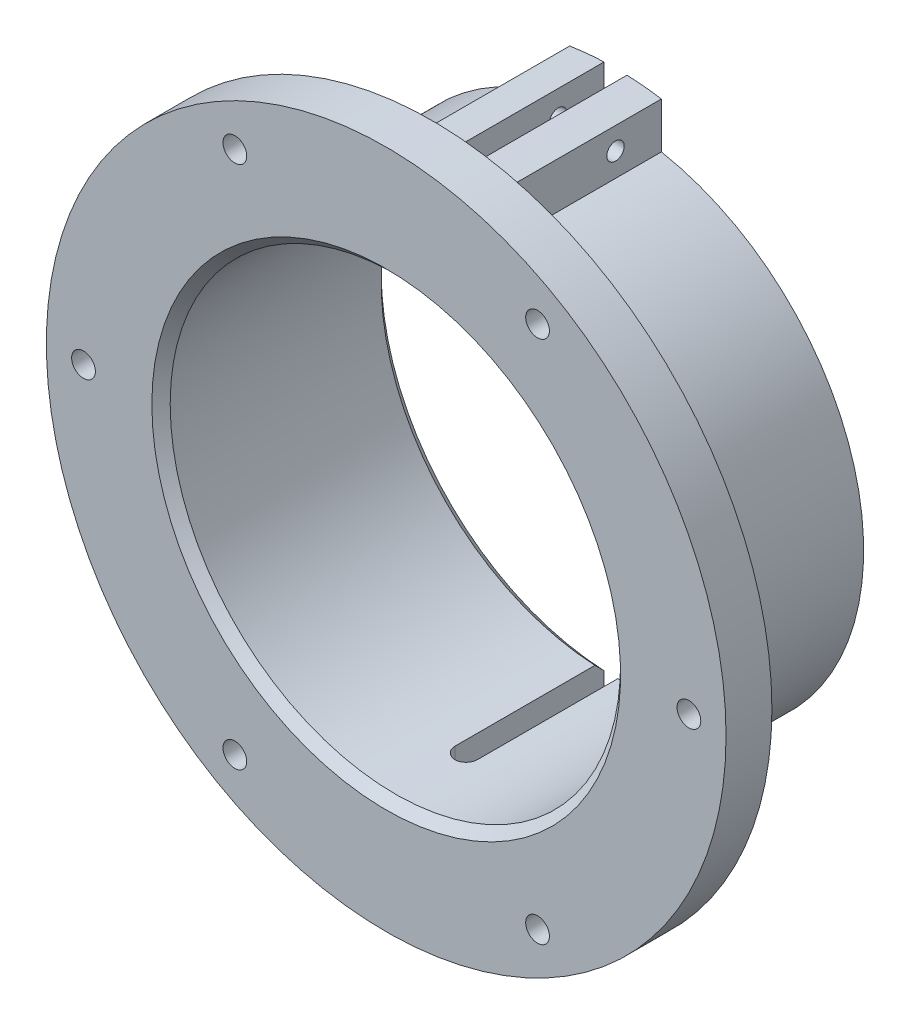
ISO-10303-21;
HEADER;
FILE_DESCRIPTION(('STEP AP214'),'2;1');
FILE_NAME('part.step','',(''),(''),'','','');
FILE_SCHEMA(('AUTOMOTIVE_DESIGN { 1 0 10303 214 1 1 1 1 }'));
ENDSEC;
DATA;
#1=APPLICATION_CONTEXT('core data for automotive mechanical design processes');
#2=APPLICATION_PROTOCOL_DEFINITION('international standard','automotive_design',2000,#1);
#3=PRODUCT_CONTEXT('',#1,'mechanical');
#4=PRODUCT('Part','Part','',(#3));
#5=PRODUCT_RELATED_PRODUCT_CATEGORY('part','',(#4));
#6=PRODUCT_DEFINITION_FORMATION('','',#4);
#7=PRODUCT_DEFINITION_CONTEXT('part definition',#1,'design');
#8=PRODUCT_DEFINITION('design','',#6,#7);
#9=PRODUCT_DEFINITION_SHAPE('','',#8);
#10=(LENGTH_UNIT() NAMED_UNIT(*) SI_UNIT(.MILLI.,.METRE.));
#11=(NAMED_UNIT(*) PLANE_ANGLE_UNIT() SI_UNIT($,.RADIAN.));
#12=(NAMED_UNIT(*) SI_UNIT($,.STERADIAN.) SOLID_ANGLE_UNIT());
#13=UNCERTAINTY_MEASURE_WITH_UNIT(LENGTH_MEASURE(1.E-05),#10,'distance_accuracy_value','');
#14=(GEOMETRIC_REPRESENTATION_CONTEXT(3) GLOBAL_UNCERTAINTY_ASSIGNED_CONTEXT((#13)) GLOBAL_UNIT_ASSIGNED_CONTEXT((#10,
#11,#12)) REPRESENTATION_CONTEXT('',''));
#15=CARTESIAN_POINT('',(0.,0.,0.));
#16=DIRECTION('',(0.,0.,1.));
#17=DIRECTION('',(1.,0.,0.));
#18=AXIS2_PLACEMENT_3D('',#15,#16,#17);
#19=CARTESIAN_POINT('',(-10.,63.1677533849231,-77.7233736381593));
#20=DIRECTION('',(1.,0.,0.));
#21=DIRECTION('',(0.,1.,0.));
#22=AXIS2_PLACEMENT_3D('',#19,#20,#21);
#23=PLANE('',#22);
#24=DIRECTION('',(0.,0.,1.));
#25=VECTOR('',#24,1.);
#26=CARTESIAN_POINT('',(-10.,53.1677533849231,-77.7233736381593));
#27=LINE('',#26,#25);
#28=CARTESIAN_POINT('',(-10.,53.1677533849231,-55.));
#29=VERTEX_POINT('',#28);
#30=CARTESIAN_POINT('',(-10.,53.1677533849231,-20.));
#31=VERTEX_POINT('',#30);
#32=EDGE_CURVE('E243',#29,#31,#27,.T.);
#33=ORIENTED_EDGE('',*,*,#32,.T.);
#34=CARTESIAN_POINT('',(-10.,53.1677533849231,-20.));
#35=CARTESIAN_POINT('',(-10.,53.1677365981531,-19.8610801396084));
#36=CARTESIAN_POINT('',(-10.,53.1736437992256,-19.7221634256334));
#37=CARTESIAN_POINT('',(-10.,53.1971843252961,-19.4453385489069));
#38=CARTESIAN_POINT('',(-10.,53.214816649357,-19.3074303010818));
#39=CARTESIAN_POINT('',(-10.,53.2616560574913,-19.0337732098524));
#40=CARTESIAN_POINT('',(-10.,53.2908485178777,-18.8980218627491));
#41=CARTESIAN_POINT('',(-10.,53.3605725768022,-18.6294646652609));
#42=CARTESIAN_POINT('',(-10.,53.4011041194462,-18.4966588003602));
#43=CARTESIAN_POINT('',(-10.,53.4931956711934,-18.234912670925));
#44=CARTESIAN_POINT('',(-10.,53.5447568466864,-18.1059728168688));
#45=CARTESIAN_POINT('',(-10.,53.658527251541,-17.8528235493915));
#46=CARTESIAN_POINT('',(-10.,53.7207404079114,-17.728615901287));
#47=CARTESIAN_POINT('',(-10.,53.8552995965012,-17.48588450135));
#48=CARTESIAN_POINT('',(-10.,53.9276414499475,-17.3673584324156));
#49=CARTESIAN_POINT('',(-10.,54.0819633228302,-17.1366942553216));
#50=CARTESIAN_POINT('',(-10.,54.1639469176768,-17.0245585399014));
#51=CARTESIAN_POINT('',(-10.,54.3375789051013,-16.8066502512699));
#52=CARTESIAN_POINT('',(-10.,54.4292955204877,-16.7009320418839));
#53=CARTESIAN_POINT('',(-10.,54.6212375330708,-16.4974529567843));
#54=CARTESIAN_POINT('',(-10.,54.7214660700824,-16.3996950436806));
#55=CARTESIAN_POINT('',(-10.,54.9296621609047,-16.2128346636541));
#56=CARTESIAN_POINT('',(-10.,55.0376285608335,-16.1237309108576));
#57=CARTESIAN_POINT('',(-10.,55.2605851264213,-15.9547077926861));
#58=CARTESIAN_POINT('',(-10.,55.3755778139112,-15.8747917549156));
#59=CARTESIAN_POINT('',(-10.,55.6136151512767,-15.7235040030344));
#60=CARTESIAN_POINT('',(-10.,55.736758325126,-15.6522872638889));
#61=CARTESIAN_POINT('',(-10.,55.9885987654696,-15.5203323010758));
#62=CARTESIAN_POINT('',(-10.,56.1172983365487,-15.4595984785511));
#63=CARTESIAN_POINT('',(-10.,56.3792148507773,-15.3490760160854));
#64=CARTESIAN_POINT('',(-10.,56.5124285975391,-15.2992798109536));
#65=CARTESIAN_POINT('',(-10.,56.7825240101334,-15.2108948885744));
#66=CARTESIAN_POINT('',(-10.,56.9194062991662,-15.1723080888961));
#67=CARTESIAN_POINT('',(-10.,57.2525537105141,-15.09315060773));
#68=CARTESIAN_POINT('',(-10.,57.4502047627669,-15.0582255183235));
#69=CARTESIAN_POINT('',(-10.,57.7484632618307,-15.0232972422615));
#70=CARTESIAN_POINT('',(-10.,57.8481350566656,-15.0145643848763));
#71=CARTESIAN_POINT('',(-10.,58.0478060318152,-15.0029168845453));
#72=CARTESIAN_POINT('',(-10.,58.1478051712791,-15.0000015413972));
#73=CARTESIAN_POINT('',(-10.,58.247832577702,-15.));
#74=B_SPLINE_CURVE_WITH_KNOTS('',3,(#34,#35,#36,#37,#38,#39,#40,#41,#42,#43,#44,#45,#46,#47,#48,
#49,#50,#51,#52,#53,#54,#55,#56,#57,#58,#59,#60,#61,#62,#63,#64,#65,#66,#67,#68,#69,#70,#71,#72,
#73),.UNSPECIFIED.,.F.,.F.,(4,2,2,2,2,2,2,2,2,2,2,2,2,2,2,2,2,2,2,4),(0.,0.41662942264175,
0.833223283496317,1.24929182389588,1.66535831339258,2.08146882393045,2.49773307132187,
2.91382608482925,3.33007388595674,3.74946074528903,4.16900298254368,4.58848278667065,
5.00811404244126,5.43437639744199,5.86081728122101,6.28696227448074,6.71318012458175,
7.31375221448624,7.61377170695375,7.91375508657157),.UNSPECIFIED.);
#75=CARTESIAN_POINT('',(-10.,58.247832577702,-15.));
#76=VERTEX_POINT('',#75);
#77=EDGE_CURVE('E376',#31,#76,#74,.T.);
#78=ORIENTED_EDGE('',*,*,#77,.T.);
#79=DIRECTION('',(0.,1.,0.));
#80=VECTOR('',#79,1.);
#81=CARTESIAN_POINT('',(-10.,63.1677533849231,-15.));
#82=LINE('',#81,#80);
#83=CARTESIAN_POINT('',(-10.,63.1677533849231,-15.));
#84=VERTEX_POINT('',#83);
#85=EDGE_CURVE('E229',#76,#84,#82,.T.);
#86=ORIENTED_EDGE('',*,*,#85,.T.);
#87=DIRECTION('',(0.,0.,1.));
#88=VECTOR('',#87,1.);
#89=CARTESIAN_POINT('',(-10.,63.1677533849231,-77.7233736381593));
#90=LINE('',#89,#88);
#91=CARTESIAN_POINT('',(-10.,63.1677533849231,-55.));
#92=VERTEX_POINT('',#91);
#93=EDGE_CURVE('E240',#92,#84,#90,.T.);
#94=ORIENTED_EDGE('',*,*,#93,.F.);
#95=DIRECTION('',(0.,-1.,0.));
#96=VECTOR('',#95,1.);
#97=CARTESIAN_POINT('',(-10.,63.1677533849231,-55.));
#98=LINE('',#97,#96);
#99=EDGE_CURVE('E218',#92,#29,#98,.T.);
#100=ORIENTED_EDGE('',*,*,#99,.T.);
#101=EDGE_LOOP('',(#33,#78,#86,#94,#100));
#102=FACE_BOUND('',#101,.T.);
#103=CARTESIAN_POINT('',(-10.,58.3322466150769,-45.));
#104=DIRECTION('',(-1.,0.,0.));
#105=DIRECTION('',(0.,0.,1.));
#106=AXIS2_PLACEMENT_3D('',#103,#104,#105);
#107=CIRCLE('',#106,3.96875);
#108=CARTESIAN_POINT('',(-10.,58.3322466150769,-41.03125));
#109=VERTEX_POINT('',#108);
#110=EDGE_CURVE('E612',#109,#109,#107,.T.);
#111=ORIENTED_EDGE('',*,*,#110,.F.);
#112=EDGE_LOOP('',(#111));
#113=FACE_BOUND('',#112,.T.);
#114=ADVANCED_FACE('F35',(#102,#113),#23,.F.);
#115=CARTESIAN_POINT('',(0.,74.1,-15.));
#116=DIRECTION('',(0.,0.,1.));
#117=DIRECTION('',(1.,0.,0.));
#118=AXIS2_PLACEMENT_3D('',#115,#116,#117);
#119=PLANE('',#118);
#120=CARTESIAN_POINT('',(0.,0.,-15.));
#121=DIRECTION('',(0.,0.,1.));
#122=DIRECTION('',(1.,0.,0.));
#123=AXIS2_PLACEMENT_3D('',#120,#121,#122);
#124=CIRCLE('',#123,74.1);
#125=CARTESIAN_POINT('',(74.1,0.,-15.));
#126=VERTEX_POINT('',#125);
#127=EDGE_CURVE('E249',#126,#126,#124,.T.);
#128=ORIENTED_EDGE('',*,*,#127,.F.);
#129=EDGE_LOOP('',(#128));
#130=FACE_BOUND('',#129,.T.);
#131=ORIENTED_EDGE('',*,*,#85,.F.);
#132=CARTESIAN_POINT('',(0.,0.,-15.));
#133=DIRECTION('',(0.,0.,1.));
#134=DIRECTION('',(1.,0.,0.));
#135=AXIS2_PLACEMENT_3D('',#132,#133,#134);
#136=CIRCLE('',#135,59.1);
#137=CARTESIAN_POINT('',(-10.,-58.247832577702,-15.));
#138=VERTEX_POINT('',#137);
#139=EDGE_CURVE('E402',#76,#138,#136,.T.);
#140=ORIENTED_EDGE('',*,*,#139,.T.);
#141=DIRECTION('',(0.,-1.,0.));
#142=VECTOR('',#141,1.);
#143=CARTESIAN_POINT('',(-10.,-63.1677533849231,-15.));
#144=LINE('',#143,#142);
#145=CARTESIAN_POINT('',(-10.,-63.1677533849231,-15.));
#146=VERTEX_POINT('',#145);
#147=EDGE_CURVE('E455',#138,#146,#144,.T.);
#148=ORIENTED_EDGE('',*,*,#147,.T.);
#149=CARTESIAN_POINT('',(0.,0.,-15.));
#150=DIRECTION('',(0.,0.,1.));
#151=DIRECTION('',(1.,0.,0.));
#152=AXIS2_PLACEMENT_3D('',#149,#150,#151);
#153=CIRCLE('',#152,63.9543983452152);
#154=CARTESIAN_POINT('',(10.,-63.1677533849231,-15.));
#155=VERTEX_POINT('',#154);
#156=EDGE_CURVE('E453',#146,#155,#153,.T.);
#157=ORIENTED_EDGE('',*,*,#156,.T.);
#158=DIRECTION('',(0.,1.,0.));
#159=VECTOR('',#158,1.);
#160=CARTESIAN_POINT('',(10.,-63.1677533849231,-15.));
#161=LINE('',#160,#159);
#162=CARTESIAN_POINT('',(10.,-58.247832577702,-15.));
#163=VERTEX_POINT('',#162);
#164=EDGE_CURVE('E427',#155,#163,#161,.T.);
#165=ORIENTED_EDGE('',*,*,#164,.T.);
#166=CARTESIAN_POINT('',(0.,0.,-15.));
#167=DIRECTION('',(0.,0.,1.));
#168=DIRECTION('',(1.,0.,0.));
#169=AXIS2_PLACEMENT_3D('',#166,#167,#168);
#170=CIRCLE('',#169,59.1);
#171=CARTESIAN_POINT('',(10.,58.247832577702,-15.));
#172=VERTEX_POINT('',#171);
#173=EDGE_CURVE('E405',#163,#172,#170,.T.);
#174=ORIENTED_EDGE('',*,*,#173,.T.);
#175=DIRECTION('',(0.,-1.,0.));
#176=VECTOR('',#175,1.);
#177=CARTESIAN_POINT('',(10.,63.1677533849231,-15.));
#178=LINE('',#177,#176);
#179=CARTESIAN_POINT('',(10.,63.1677533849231,-15.));
#180=VERTEX_POINT('',#179);
#181=EDGE_CURVE('E233',#180,#172,#178,.T.);
#182=ORIENTED_EDGE('',*,*,#181,.F.);
#183=CARTESIAN_POINT('',(0.,0.,-15.));
#184=DIRECTION('',(0.,0.,-1.));
#185=DIRECTION('',(1.,0.,0.));
#186=AXIS2_PLACEMENT_3D('',#183,#184,#185);
#187=CIRCLE('',#186,63.9543983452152);
#188=EDGE_CURVE('E231',#84,#180,#187,.T.);
#189=ORIENTED_EDGE('',*,*,#188,.F.);
#190=EDGE_LOOP('',(#131,#140,#148,#157,#165,#174,#182,#189));
#191=FACE_BOUND('',#190,.T.);
#192=CARTESIAN_POINT('',(-33.0000000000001,57.1576766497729,-15.));
#193=DIRECTION('',(0.,0.,1.));
#194=DIRECTION('',(1.,0.,0.));
#195=AXIS2_PLACEMENT_3D('',#192,#193,#194);
#196=CIRCLE('',#195,2.59079999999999);
#197=CARTESIAN_POINT('',(-30.4092000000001,57.1576766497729,-15.));
#198=VERTEX_POINT('',#197);
#199=EDGE_CURVE('E413',#198,#198,#196,.F.);
#200=ORIENTED_EDGE('',*,*,#199,.F.);
#201=EDGE_LOOP('',(#200));
#202=FACE_BOUND('',#201,.T.);
#203=CARTESIAN_POINT('',(33.,57.1576766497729,-15.));
#204=DIRECTION('',(0.,0.,1.));
#205=DIRECTION('',(1.,0.,0.));
#206=AXIS2_PLACEMENT_3D('',#203,#204,#205);
#207=CIRCLE('',#206,2.59079999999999);
#208=CARTESIAN_POINT('',(35.5908,57.1576766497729,-15.));
#209=VERTEX_POINT('',#208);
#210=EDGE_CURVE('E552',#209,#209,#207,.F.);
#211=ORIENTED_EDGE('',*,*,#210,.F.);
#212=EDGE_LOOP('',(#211));
#213=FACE_BOUND('',#212,.T.);
#214=CARTESIAN_POINT('',(66.,-2.04697370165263E-13,-15.));
#215=DIRECTION('',(0.,0.,1.));
#216=DIRECTION('',(1.,0.,0.));
#217=AXIS2_PLACEMENT_3D('',#214,#215,#216);
#218=CIRCLE('',#217,2.5908);
#219=CARTESIAN_POINT('',(68.5908,-2.04697370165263E-13,-15.));
#220=VERTEX_POINT('',#219);
#221=EDGE_CURVE('E558',#220,#220,#218,.F.);
#222=ORIENTED_EDGE('',*,*,#221,.F.);
#223=EDGE_LOOP('',(#222));
#224=FACE_BOUND('',#223,.T.);
#225=CARTESIAN_POINT('',(33.0000000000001,-57.1576766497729,-15.));
#226=DIRECTION('',(0.,0.,1.));
#227=DIRECTION('',(1.,0.,0.));
#228=AXIS2_PLACEMENT_3D('',#225,#226,#227);
#229=CIRCLE('',#228,2.59079999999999);
#230=CARTESIAN_POINT('',(35.5908000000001,-57.1576766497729,-15.));
#231=VERTEX_POINT('',#230);
#232=EDGE_CURVE('E564',#231,#231,#229,.F.);
#233=ORIENTED_EDGE('',*,*,#232,.F.);
#234=EDGE_LOOP('',(#233));
#235=FACE_BOUND('',#234,.T.);
#236=CARTESIAN_POINT('',(-33.0000000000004,-57.1576766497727,-15.));
#237=DIRECTION('',(0.,0.,1.));
#238=DIRECTION('',(1.,0.,0.));
#239=AXIS2_PLACEMENT_3D('',#236,#237,#238);
#240=CIRCLE('',#239,2.59079999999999);
#241=CARTESIAN_POINT('',(-30.4092000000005,-57.1576766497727,-15.));
#242=VERTEX_POINT('',#241);
#243=EDGE_CURVE('E570',#242,#242,#240,.F.);
#244=ORIENTED_EDGE('',*,*,#243,.F.);
#245=EDGE_LOOP('',(#244));
#246=FACE_BOUND('',#245,.T.);
#247=CARTESIAN_POINT('',(-66.,6.66133814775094E-13,-15.));
#248=DIRECTION('',(0.,0.,1.));
#249=DIRECTION('',(1.,0.,0.));
#250=AXIS2_PLACEMENT_3D('',#247,#248,#249);
#251=CIRCLE('',#250,2.5908);
#252=CARTESIAN_POINT('',(-63.4092,6.66133814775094E-13,-15.));
#253=VERTEX_POINT('',#252);
#254=EDGE_CURVE('E576',#253,#253,#251,.F.);
#255=ORIENTED_EDGE('',*,*,#254,.F.);
#256=EDGE_LOOP('',(#255));
#257=FACE_BOUND('',#256,.T.);
#258=ADVANCED_FACE('F363',(#130,#191,#202,#213,#224,#235,#246,#257),#119,.F.);
#259=CARTESIAN_POINT('',(0.,49.1,-55.));
#260=DIRECTION('',(0.,0.,1.));
#261=DIRECTION('',(1.,0.,0.));
#262=AXIS2_PLACEMENT_3D('',#259,#260,#261);
#263=PLANE('',#262);
#264=DIRECTION('',(0.,-1.,0.));
#265=VECTOR('',#264,1.);
#266=CARTESIAN_POINT('',(2.5,74.0578152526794,-55.));
#267=LINE('',#266,#265);
#268=CARTESIAN_POINT('',(2.5,-51.0388087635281,-55.));
#269=VERTEX_POINT('',#268);
#270=CARTESIAN_POINT('',(2.5,-63.9055167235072,-55.));
#271=VERTEX_POINT('',#270);
#272=EDGE_CURVE('E211',#269,#271,#267,.T.);
#273=ORIENTED_EDGE('',*,*,#272,.F.);
#274=CARTESIAN_POINT('',(0.,0.,-55.));
#275=DIRECTION('',(0.,0.,1.));
#276=DIRECTION('',(1.,0.,0.));
#277=AXIS2_PLACEMENT_3D('',#274,#275,#276);
#278=CIRCLE('',#277,51.1);
#279=CARTESIAN_POINT('',(2.5,51.0388087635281,-55.));
#280=VERTEX_POINT('',#279);
#281=EDGE_CURVE('E209',#269,#280,#278,.T.);
#282=ORIENTED_EDGE('',*,*,#281,.T.);
#283=CARTESIAN_POINT('',(2.5,63.9055167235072,-55.));
#284=VERTEX_POINT('',#283);
#285=EDGE_CURVE('E191',#284,#280,#267,.T.);
#286=ORIENTED_EDGE('',*,*,#285,.F.);
#287=CARTESIAN_POINT('',(0.,0.,-55.));
#288=DIRECTION('',(0.,0.,1.));
#289=DIRECTION('',(1.,0.,0.));
#290=AXIS2_PLACEMENT_3D('',#287,#288,#289);
#291=CIRCLE('',#290,63.9543983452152);
#292=CARTESIAN_POINT('',(10.,63.1677533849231,-55.));
#293=VERTEX_POINT('',#292);
#294=EDGE_CURVE('E206',#293,#284,#291,.T.);
#295=ORIENTED_EDGE('',*,*,#294,.F.);
#296=DIRECTION('',(0.,1.,0.));
#297=VECTOR('',#296,1.);
#298=CARTESIAN_POINT('',(10.,63.1677533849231,-55.));
#299=LINE('',#298,#297);
#300=CARTESIAN_POINT('',(10.,53.1677533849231,-55.));
#301=VERTEX_POINT('',#300);
#302=EDGE_CURVE('E224',#301,#293,#299,.T.);
#303=ORIENTED_EDGE('',*,*,#302,.F.);
#304=CARTESIAN_POINT('',(0.,0.,-55.));
#305=DIRECTION('',(0.,0.,1.));
#306=DIRECTION('',(1.,0.,0.));
#307=AXIS2_PLACEMENT_3D('',#304,#305,#306);
#308=CIRCLE('',#307,54.1);
#309=CARTESIAN_POINT('',(10.,-53.1677533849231,-55.));
#310=VERTEX_POINT('',#309);
#311=EDGE_CURVE('E222',#310,#301,#308,.T.);
#312=ORIENTED_EDGE('',*,*,#311,.F.);
#313=DIRECTION('',(0.,-1.,0.));
#314=VECTOR('',#313,1.);
#315=CARTESIAN_POINT('',(10.,-63.1677533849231,-55.));
#316=LINE('',#315,#314);
#317=CARTESIAN_POINT('',(10.,-63.1677533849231,-55.));
#318=VERTEX_POINT('',#317);
#319=EDGE_CURVE('E448',#310,#318,#316,.T.);
#320=ORIENTED_EDGE('',*,*,#319,.T.);
#321=CARTESIAN_POINT('',(0.,0.,-55.));
#322=DIRECTION('',(0.,0.,1.));
#323=DIRECTION('',(1.,0.,0.));
#324=AXIS2_PLACEMENT_3D('',#321,#322,#323);
#325=CIRCLE('',#324,63.9543983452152);
#326=EDGE_CURVE('E445',#318,#271,#325,.F.);
#327=ORIENTED_EDGE('',*,*,#326,.T.);
#328=EDGE_LOOP('',(#273,#282,#286,#295,#303,#312,#320,#327));
#329=FACE_BOUND('',#328,.T.);
#330=ADVANCED_FACE('F204',(#329),#263,.F.);
#331=CARTESIAN_POINT('',(0.,0.,0.));
#332=DIRECTION('',(0.,0.,1.));
#333=DIRECTION('',(1.,0.,0.));
#334=AXIS2_PLACEMENT_3D('',#331,#332,#333);
#335=CYLINDRICAL_SURFACE('',#334,54.1);
#336=DIRECTION('',(0.,0.,1.));
#337=VECTOR('',#336,1.);
#338=CARTESIAN_POINT('',(10.,53.1677533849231,-77.7233736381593));
#339=LINE('',#338,#337);
#340=CARTESIAN_POINT('',(10.,53.1677533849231,-20.));
#341=VERTEX_POINT('',#340);
#342=EDGE_CURVE('E236',#301,#341,#339,.T.);
#343=ORIENTED_EDGE('',*,*,#342,.T.);
#344=CARTESIAN_POINT('',(0.,0.,-20.));
#345=DIRECTION('',(0.,0.,1.));
#346=DIRECTION('',(1.,0.,0.));
#347=AXIS2_PLACEMENT_3D('',#344,#345,#346);
#348=CIRCLE('',#347,54.1);
#349=CARTESIAN_POINT('',(10.,-53.1677533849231,-20.));
#350=VERTEX_POINT('',#349);
#351=EDGE_CURVE('E699',#341,#350,#348,.F.);
#352=ORIENTED_EDGE('',*,*,#351,.T.);
#353=DIRECTION('',(0.,0.,1.));
#354=VECTOR('',#353,1.);
#355=CARTESIAN_POINT('',(10.,-53.1677533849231,-77.7233736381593));
#356=LINE('',#355,#354);
#357=EDGE_CURVE('E465',#310,#350,#356,.T.);
#358=ORIENTED_EDGE('',*,*,#357,.F.);
#359=ORIENTED_EDGE('',*,*,#311,.T.);
#360=EDGE_LOOP('',(#343,#352,#358,#359));
#361=FACE_BOUND('',#360,.T.);
#362=ADVANCED_FACE('F359',(#361),#335,.T.);
#363=DIRECTION('',(0.,0.,1.));
#364=VECTOR('',#363,1.);
#365=CARTESIAN_POINT('',(-10.,-53.1677533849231,-77.7233736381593));
#366=LINE('',#365,#364);
#367=CARTESIAN_POINT('',(-10.,-53.1677533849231,-55.));
#368=VERTEX_POINT('',#367);
#369=CARTESIAN_POINT('',(-10.,-53.1677533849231,-20.));
#370=VERTEX_POINT('',#369);
#371=EDGE_CURVE('E457',#368,#370,#366,.T.);
#372=ORIENTED_EDGE('',*,*,#371,.T.);
#373=CARTESIAN_POINT('',(0.,0.,-20.));
#374=DIRECTION('',(0.,0.,1.));
#375=DIRECTION('',(1.,0.,0.));
#376=AXIS2_PLACEMENT_3D('',#373,#374,#375);
#377=CIRCLE('',#376,54.1);
#378=EDGE_CURVE('E383',#370,#31,#377,.F.);
#379=ORIENTED_EDGE('',*,*,#378,.T.);
#380=ORIENTED_EDGE('',*,*,#32,.F.);
#381=EDGE_CURVE('E247',#29,#368,#308,.T.);
#382=ORIENTED_EDGE('',*,*,#381,.T.);
#383=EDGE_LOOP('',(#372,#379,#380,#382));
#384=FACE_BOUND('',#383,.T.);
#385=ADVANCED_FACE('F354',(#384),#335,.T.);
#386=DIRECTION('',(0.,1.,0.));
#387=VECTOR('',#386,1.);
#388=CARTESIAN_POINT('',(-2.5,74.0578152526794,-55.));
#389=LINE('',#388,#387);
#390=CARTESIAN_POINT('',(-2.5,51.0388087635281,-55.));
#391=VERTEX_POINT('',#390);
#392=CARTESIAN_POINT('',(-2.5,63.9055167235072,-55.));
#393=VERTEX_POINT('',#392);
#394=EDGE_CURVE('E210',#391,#393,#389,.T.);
#395=ORIENTED_EDGE('',*,*,#394,.F.);
#396=CARTESIAN_POINT('',(0.,0.,-55.));
#397=DIRECTION('',(0.,0.,1.));
#398=DIRECTION('',(1.,0.,0.));
#399=AXIS2_PLACEMENT_3D('',#396,#397,#398);
#400=CIRCLE('',#399,51.1);
#401=CARTESIAN_POINT('',(-2.5,-51.0388087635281,-55.));
#402=VERTEX_POINT('',#401);
#403=EDGE_CURVE('E492',#391,#402,#400,.T.);
#404=ORIENTED_EDGE('',*,*,#403,.T.);
#405=CARTESIAN_POINT('',(-2.5,-63.9055167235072,-55.));
#406=VERTEX_POINT('',#405);
#407=EDGE_CURVE('E436',#406,#402,#389,.T.);
#408=ORIENTED_EDGE('',*,*,#407,.F.);
#409=CARTESIAN_POINT('',(-10.,-63.1677533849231,-55.));
#410=VERTEX_POINT('',#409);
#411=EDGE_CURVE('E449',#406,#410,#325,.F.);
#412=ORIENTED_EDGE('',*,*,#411,.T.);
#413=DIRECTION('',(0.,1.,0.));
#414=VECTOR('',#413,1.);
#415=CARTESIAN_POINT('',(-10.,-63.1677533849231,-55.));
#416=LINE('',#415,#414);
#417=EDGE_CURVE('E226',#410,#368,#416,.T.);
#418=ORIENTED_EDGE('',*,*,#417,.T.);
#419=ORIENTED_EDGE('',*,*,#381,.F.);
#420=ORIENTED_EDGE('',*,*,#99,.F.);
#421=EDGE_CURVE('E219',#393,#92,#291,.T.);
#422=ORIENTED_EDGE('',*,*,#421,.F.);
#423=EDGE_LOOP('',(#395,#404,#408,#412,#418,#419,#420,#422));
#424=FACE_BOUND('',#423,.T.);
#425=ADVANCED_FACE('F347',(#424),#263,.F.);
#426=CARTESIAN_POINT('',(0.,0.,0.));
#427=DIRECTION('',(0.,0.,1.));
#428=DIRECTION('',(1.,0.,0.));
#429=AXIS2_PLACEMENT_3D('',#426,#427,#428);
#430=CYLINDRICAL_SURFACE('',#429,49.1);
#431=CARTESIAN_POINT('',(0.,0.,-7.00000000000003));
#432=DIRECTION('',(0.,0.,-1.));
#433=DIRECTION('',(-1.,0.,0.));
#434=AXIS2_PLACEMENT_3D('',#431,#432,#433);
#435=CIRCLE('',#434,49.1);
#436=CARTESIAN_POINT('',(-49.1,0.,-7.00000000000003));
#437=VERTEX_POINT('',#436);
#438=EDGE_CURVE('E44',#437,#437,#435,.F.);
#439=ORIENTED_EDGE('',*,*,#438,.T.);
#440=EDGE_LOOP('',(#439));
#441=FACE_BOUND('',#440,.T.);
#442=DIRECTION('',(0.,0.,1.));
#443=VECTOR('',#442,1.);
#444=CARTESIAN_POINT('',(2.5,49.0363130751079,0.));
#445=LINE('',#444,#443);
#446=CARTESIAN_POINT('',(2.5,49.0363130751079,-22.5));
#447=VERTEX_POINT('',#446);
#448=CARTESIAN_POINT('',(2.5,49.0363130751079,-53.));
#449=VERTEX_POINT('',#448);
#450=EDGE_CURVE('E422',#447,#449,#445,.F.);
#451=ORIENTED_EDGE('',*,*,#450,.T.);
#452=CARTESIAN_POINT('',(0.,0.,-53.));
#453=DIRECTION('',(0.,0.,1.));
#454=DIRECTION('',(1.,0.,0.));
#455=AXIS2_PLACEMENT_3D('',#452,#453,#454);
#456=CIRCLE('',#455,49.1);
#457=CARTESIAN_POINT('',(2.5,-49.0363130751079,-53.));
#458=VERTEX_POINT('',#457);
#459=EDGE_CURVE('E497',#449,#458,#456,.F.);
#460=ORIENTED_EDGE('',*,*,#459,.T.);
#461=DIRECTION('',(0.,0.,1.));
#462=VECTOR('',#461,1.);
#463=CARTESIAN_POINT('',(2.5,-49.0363130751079,0.));
#464=LINE('',#463,#462);
#465=CARTESIAN_POINT('',(2.5,-49.0363130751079,-22.5));
#466=VERTEX_POINT('',#465);
#467=EDGE_CURVE('E198',#458,#466,#464,.T.);
#468=ORIENTED_EDGE('',*,*,#467,.T.);
#469=CARTESIAN_POINT('',(2.5,-49.0363130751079,-22.5));
#470=CARTESIAN_POINT('',(2.5000067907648,-49.0363116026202,-22.4297318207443));
#471=CARTESIAN_POINT('',(2.49703745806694,-49.0364640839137,-22.3594668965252));
#472=CARTESIAN_POINT('',(2.48519910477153,-49.0370660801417,-22.2194406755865));
#473=CARTESIAN_POINT('',(2.47633039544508,-49.0375155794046,-22.1496793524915));
#474=CARTESIAN_POINT('',(2.45275537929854,-49.0387002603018,-22.0112059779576));
#475=CARTESIAN_POINT('',(2.43805380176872,-49.0394352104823,-21.9424931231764));
#476=CARTESIAN_POINT('',(2.40293300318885,-49.0411686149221,-21.8065685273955));
#477=CARTESIAN_POINT('',(2.38251384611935,-49.0421670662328,-21.7393567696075));
#478=CARTESIAN_POINT('',(2.31284733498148,-49.0455190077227,-21.5406242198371));
#479=CARTESIAN_POINT('',(2.25518073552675,-49.0482296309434,-21.4119465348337));
#480=CARTESIAN_POINT('',(2.11912805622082,-49.0542954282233,-21.1661900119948));
#481=CARTESIAN_POINT('',(2.0407452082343,-49.0576505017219,-21.0491093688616));
#482=CARTESIAN_POINT('',(1.865384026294,-49.0646311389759,-20.8296481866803));
#483=CARTESIAN_POINT('',(1.76839090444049,-49.0682569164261,-20.7272794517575));
#484=CARTESIAN_POINT('',(1.5585757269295,-49.0753689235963,-20.5402558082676));
#485=CARTESIAN_POINT('',(1.44575059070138,-49.0788551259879,-20.4556043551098));
#486=CARTESIAN_POINT('',(1.2074037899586,-49.0852970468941,-20.3063805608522));
#487=CARTESIAN_POINT('',(1.08187276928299,-49.0882523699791,-20.2418231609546));
#488=CARTESIAN_POINT('',(0.821761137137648,-49.0932946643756,-20.1347389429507));
#489=CARTESIAN_POINT('',(0.687185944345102,-49.0953821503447,-20.0921990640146));
#490=CARTESIAN_POINT('',(0.459825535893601,-49.0979299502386,-20.0409072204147));
#491=CARTESIAN_POINT('',(0.368473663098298,-49.0987025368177,-20.0255768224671));
#492=CARTESIAN_POINT('',(0.184760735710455,-49.0997390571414,-20.0051242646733));
#493=CARTESIAN_POINT('',(0.092401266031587,-49.1000036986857,-19.9999878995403));
#494=CARTESIAN_POINT('',(0.,-49.1,-20.));
#495=B_SPLINE_CURVE_WITH_KNOTS('',3,(#469,#470,#471,#472,#473,#474,#475,#476,#477,#478,#479,
#480,#481,#482,#483,#484,#485,#486,#487,#488,#489,#490,#491,#492,#493,#494),.UNSPECIFIED.,.F.,
.F.,(4,2,2,2,2,2,2,2,2,2,2,2,4),(0.,0.210735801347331,0.421460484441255,0.632014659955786,
0.842566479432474,1.26349094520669,1.68434978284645,2.10554443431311,2.52682115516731,
2.94841037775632,3.36974922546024,3.64711551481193,3.92409502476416),.UNSPECIFIED.);
#496=CARTESIAN_POINT('',(0.,-49.1,-20.));
#497=VERTEX_POINT('',#496);
#498=EDGE_CURVE('E276',#466,#497,#495,.T.);
#499=ORIENTED_EDGE('',*,*,#498,.T.);
#500=CARTESIAN_POINT('',(0.,-49.1,-20.));
#501=CARTESIAN_POINT('',(-0.0702682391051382,-49.1000014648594,-19.9999932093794));
#502=CARTESIAN_POINT('',(-0.140533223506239,-49.0998491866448,-20.0029625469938));
#503=CARTESIAN_POINT('',(-0.280559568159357,-49.0992479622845,-20.0148009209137));
#504=CARTESIAN_POINT('',(-0.350320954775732,-49.0987990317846,-20.0236696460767));
#505=CARTESIAN_POINT('',(-0.488794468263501,-49.0976157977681,-20.0472447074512));
#506=CARTESIAN_POINT('',(-0.557507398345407,-49.0968817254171,-20.0619463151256));
#507=CARTESIAN_POINT('',(-0.693432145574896,-49.0951502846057,-20.0970671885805));
#508=CARTESIAN_POINT('',(-0.760643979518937,-49.0941529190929,-20.1174863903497));
#509=CARTESIAN_POINT('',(-0.959376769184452,-49.0908043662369,-20.1871530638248));
#510=CARTESIAN_POINT('',(-1.08805461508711,-49.0880961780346,-20.2448198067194));
#511=CARTESIAN_POINT('',(-1.33381140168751,-49.0820345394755,-20.3808728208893));
#512=CARTESIAN_POINT('',(-1.45089214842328,-49.078681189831,-20.4592558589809));
#513=CARTESIAN_POINT('',(-1.67035320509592,-49.0717025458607,-20.6346172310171));
#514=CARTESIAN_POINT('',(-1.7727217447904,-49.06807703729,-20.7316103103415));
#515=CARTESIAN_POINT('',(-1.95974501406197,-49.0609639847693,-20.9414253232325));
#516=CARTESIAN_POINT('',(-2.04439628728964,-49.0574764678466,-21.0542503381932));
#517=CARTESIAN_POINT('',(-2.19361989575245,-49.0510309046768,-21.292597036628));
#518=CARTESIAN_POINT('',(-2.2581772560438,-49.0480732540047,-21.4181280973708));
#519=CARTESIAN_POINT('',(-2.36526138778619,-49.0430263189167,-21.6782398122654));
#520=CARTESIAN_POINT('',(-2.40780122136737,-49.0409365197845,-21.8128150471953));
#521=CARTESIAN_POINT('',(-2.45909293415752,-49.0383857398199,-22.0401753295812));
#522=CARTESIAN_POINT('',(-2.47442327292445,-49.0376121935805,-22.131527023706));
#523=CARTESIAN_POINT('',(-2.4948757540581,-49.0365743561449,-22.3152396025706));
#524=CARTESIAN_POINT('',(-2.50001210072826,-49.0363093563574,-22.4075989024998));
#525=CARTESIAN_POINT('',(-2.5,-49.0363130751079,-22.5));
#526=B_SPLINE_CURVE_WITH_KNOTS('',3,(#500,#501,#502,#503,#504,#505,#506,#507,#508,#509,#510,
#511,#512,#513,#514,#515,#516,#517,#518,#519,#520,#521,#522,#523,#524,#525),.UNSPECIFIED.,.F.,
.F.,(4,2,2,2,2,2,2,2,2,2,2,2,4),(0.,0.210735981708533,0.421460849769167,0.632015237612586,
0.842567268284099,1.26349219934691,1.68435147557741,2.1055456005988,2.52682181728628,
2.94841124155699,3.369750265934,3.64711602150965,3.92409502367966),.UNSPECIFIED.);
#527=CARTESIAN_POINT('',(-2.5,-49.0363130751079,-22.5));
#528=VERTEX_POINT('',#527);
#529=EDGE_CURVE('E306',#497,#528,#526,.T.);
#530=ORIENTED_EDGE('',*,*,#529,.T.);
#531=DIRECTION('',(0.,0.,1.));
#532=VECTOR('',#531,1.);
#533=CARTESIAN_POINT('',(-2.5,-49.0363130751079,0.));
#534=LINE('',#533,#532);
#535=CARTESIAN_POINT('',(-2.5,-49.0363130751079,-53.));
#536=VERTEX_POINT('',#535);
#537=EDGE_CURVE('E199',#528,#536,#534,.F.);
#538=ORIENTED_EDGE('',*,*,#537,.T.);
#539=CARTESIAN_POINT('',(0.,0.,-53.));
#540=DIRECTION('',(0.,0.,1.));
#541=DIRECTION('',(1.,0.,0.));
#542=AXIS2_PLACEMENT_3D('',#539,#540,#541);
#543=CIRCLE('',#542,49.1);
#544=CARTESIAN_POINT('',(-2.5,49.0363130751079,-53.));
#545=VERTEX_POINT('',#544);
#546=EDGE_CURVE('E532',#536,#545,#543,.F.);
#547=ORIENTED_EDGE('',*,*,#546,.T.);
#548=DIRECTION('',(0.,0.,1.));
#549=VECTOR('',#548,1.);
#550=CARTESIAN_POINT('',(-2.5,49.0363130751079,0.));
#551=LINE('',#550,#549);
#552=CARTESIAN_POINT('',(-2.5,49.0363130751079,-22.5));
#553=VERTEX_POINT('',#552);
#554=EDGE_CURVE('E435',#545,#553,#551,.T.);
#555=ORIENTED_EDGE('',*,*,#554,.T.);
#556=CARTESIAN_POINT('',(-2.5,49.0363130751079,-22.5));
#557=CARTESIAN_POINT('',(-2.5000067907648,49.0363116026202,-22.4297318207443));
#558=CARTESIAN_POINT('',(-2.49703745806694,49.0364640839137,-22.3594668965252));
#559=CARTESIAN_POINT('',(-2.48519910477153,49.0370660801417,-22.2194406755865));
#560=CARTESIAN_POINT('',(-2.47633039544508,49.0375155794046,-22.1496793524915));
#561=CARTESIAN_POINT('',(-2.45275537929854,49.0387002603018,-22.0112059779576));
#562=CARTESIAN_POINT('',(-2.43805380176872,49.0394352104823,-21.9424931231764));
#563=CARTESIAN_POINT('',(-2.40293300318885,49.0411686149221,-21.8065685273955));
#564=CARTESIAN_POINT('',(-2.38251384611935,49.0421670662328,-21.7393567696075));
#565=CARTESIAN_POINT('',(-2.31284733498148,49.0455190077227,-21.5406242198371));
#566=CARTESIAN_POINT('',(-2.25518073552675,49.0482296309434,-21.4119465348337));
#567=CARTESIAN_POINT('',(-2.11912805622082,49.0542954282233,-21.1661900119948));
#568=CARTESIAN_POINT('',(-2.0407452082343,49.0576505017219,-21.0491093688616));
#569=CARTESIAN_POINT('',(-1.865384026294,49.0646311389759,-20.8296481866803));
#570=CARTESIAN_POINT('',(-1.76839090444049,49.0682569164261,-20.7272794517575));
#571=CARTESIAN_POINT('',(-1.5585757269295,49.0753689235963,-20.5402558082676));
#572=CARTESIAN_POINT('',(-1.44575059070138,49.0788551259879,-20.4556043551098));
#573=CARTESIAN_POINT('',(-1.2074037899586,49.0852970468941,-20.3063805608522));
#574=CARTESIAN_POINT('',(-1.08187276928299,49.0882523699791,-20.2418231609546));
#575=CARTESIAN_POINT('',(-0.821761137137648,49.0932946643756,-20.1347389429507));
#576=CARTESIAN_POINT('',(-0.687185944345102,49.0953821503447,-20.0921990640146));
#577=CARTESIAN_POINT('',(-0.459825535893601,49.0979299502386,-20.0409072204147));
#578=CARTESIAN_POINT('',(-0.368473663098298,49.0987025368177,-20.0255768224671));
#579=CARTESIAN_POINT('',(-0.184760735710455,49.0997390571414,-20.0051242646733));
#580=CARTESIAN_POINT('',(-0.092401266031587,49.1000036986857,-19.9999878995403));
#581=CARTESIAN_POINT('',(0.,49.1,-20.));
#582=B_SPLINE_CURVE_WITH_KNOTS('',3,(#556,#557,#558,#559,#560,#561,#562,#563,#564,#565,#566,
#567,#568,#569,#570,#571,#572,#573,#574,#575,#576,#577,#578,#579,#580,#581),.UNSPECIFIED.,.F.,
.F.,(4,2,2,2,2,2,2,2,2,2,2,2,4),(0.,0.210735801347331,0.421460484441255,0.632014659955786,
0.842566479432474,1.26349094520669,1.68434978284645,2.10554443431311,2.52682115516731,
2.94841037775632,3.36974922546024,3.64711551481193,3.92409502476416),.UNSPECIFIED.);
#583=CARTESIAN_POINT('',(0.,49.1,-20.));
#584=VERTEX_POINT('',#583);
#585=EDGE_CURVE('E332',#553,#584,#582,.T.);
#586=ORIENTED_EDGE('',*,*,#585,.T.);
#587=CARTESIAN_POINT('',(0.,49.1,-20.));
#588=CARTESIAN_POINT('',(0.0702682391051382,49.1000014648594,-19.9999932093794));
#589=CARTESIAN_POINT('',(0.140533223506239,49.0998491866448,-20.0029625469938));
#590=CARTESIAN_POINT('',(0.280559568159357,49.0992479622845,-20.0148009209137));
#591=CARTESIAN_POINT('',(0.350320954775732,49.0987990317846,-20.0236696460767));
#592=CARTESIAN_POINT('',(0.488794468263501,49.0976157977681,-20.0472447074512));
#593=CARTESIAN_POINT('',(0.557507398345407,49.0968817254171,-20.0619463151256));
#594=CARTESIAN_POINT('',(0.693432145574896,49.0951502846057,-20.0970671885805));
#595=CARTESIAN_POINT('',(0.760643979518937,49.0941529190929,-20.1174863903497));
#596=CARTESIAN_POINT('',(0.959376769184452,49.0908043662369,-20.1871530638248));
#597=CARTESIAN_POINT('',(1.08805461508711,49.0880961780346,-20.2448198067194));
#598=CARTESIAN_POINT('',(1.33381140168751,49.0820345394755,-20.3808728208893));
#599=CARTESIAN_POINT('',(1.45089214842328,49.078681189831,-20.4592558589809));
#600=CARTESIAN_POINT('',(1.67035320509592,49.0717025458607,-20.6346172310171));
#601=CARTESIAN_POINT('',(1.7727217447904,49.06807703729,-20.7316103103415));
#602=CARTESIAN_POINT('',(1.95974501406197,49.0609639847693,-20.9414253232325));
#603=CARTESIAN_POINT('',(2.04439628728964,49.0574764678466,-21.0542503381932));
#604=CARTESIAN_POINT('',(2.19361989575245,49.0510309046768,-21.292597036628));
#605=CARTESIAN_POINT('',(2.2581772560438,49.0480732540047,-21.4181280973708));
#606=CARTESIAN_POINT('',(2.36526138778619,49.0430263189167,-21.6782398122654));
#607=CARTESIAN_POINT('',(2.40780122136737,49.0409365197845,-21.8128150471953));
#608=CARTESIAN_POINT('',(2.45909293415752,49.0383857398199,-22.0401753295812));
#609=CARTESIAN_POINT('',(2.47442327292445,49.0376121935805,-22.131527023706));
#610=CARTESIAN_POINT('',(2.4948757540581,49.0365743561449,-22.3152396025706));
#611=CARTESIAN_POINT('',(2.50001210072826,49.0363093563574,-22.4075989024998));
#612=CARTESIAN_POINT('',(2.5,49.0363130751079,-22.5));
#613=B_SPLINE_CURVE_WITH_KNOTS('',3,(#587,#588,#589,#590,#591,#592,#593,#594,#595,#596,#597,
#598,#599,#600,#601,#602,#603,#604,#605,#606,#607,#608,#609,#610,#611,#612),.UNSPECIFIED.,.F.,
.F.,(4,2,2,2,2,2,2,2,2,2,2,2,4),(0.,0.210735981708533,0.421460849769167,0.632015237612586,
0.842567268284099,1.26349219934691,1.68435147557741,2.1055456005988,2.52682181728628,
2.94841124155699,3.369750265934,3.64711602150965,3.92409502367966),.UNSPECIFIED.);
#614=EDGE_CURVE('E337',#584,#447,#613,.T.);
#615=ORIENTED_EDGE('',*,*,#614,.T.);
#616=EDGE_LOOP('',(#451,#460,#468,#499,#530,#538,#547,#555,#586,#615));
#617=FACE_BOUND('',#616,.T.);
#618=ADVANCED_FACE('F342',(#441,#617),#430,.F.);
#619=CARTESIAN_POINT('',(0.,49.1,-4.99999999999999));
#620=DIRECTION('',(0.,0.,-1.));
#621=DIRECTION('',(-1.,0.,0.));
#622=AXIS2_PLACEMENT_3D('',#619,#620,#621);
#623=PLANE('',#622);
#624=CARTESIAN_POINT('',(-66.,6.66133814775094E-13,-4.99999999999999));
#625=DIRECTION('',(0.,0.,1.));
#626=DIRECTION('',(1.,0.,0.));
#627=AXIS2_PLACEMENT_3D('',#624,#625,#626);
#628=CIRCLE('',#627,2.59079999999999);
#629=CARTESIAN_POINT('',(-63.4092,6.66133814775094E-13,-4.99999999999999));
#630=VERTEX_POINT('',#629);
#631=EDGE_CURVE('E579',#630,#630,#628,.T.);
#632=ORIENTED_EDGE('',*,*,#631,.F.);
#633=EDGE_LOOP('',(#632));
#634=FACE_BOUND('',#633,.T.);
#635=CARTESIAN_POINT('',(-33.0000000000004,-57.1576766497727,-4.99999999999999));
#636=DIRECTION('',(0.,0.,1.));
#637=DIRECTION('',(1.,0.,0.));
#638=AXIS2_PLACEMENT_3D('',#635,#636,#637);
#639=CIRCLE('',#638,2.59079999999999);
#640=CARTESIAN_POINT('',(-30.4092000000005,-57.1576766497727,-4.99999999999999));
#641=VERTEX_POINT('',#640);
#642=EDGE_CURVE('E573',#641,#641,#639,.T.);
#643=ORIENTED_EDGE('',*,*,#642,.F.);
#644=EDGE_LOOP('',(#643));
#645=FACE_BOUND('',#644,.T.);
#646=CARTESIAN_POINT('',(33.0000000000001,-57.1576766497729,-4.99999999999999));
#647=DIRECTION('',(0.,0.,1.));
#648=DIRECTION('',(1.,0.,0.));
#649=AXIS2_PLACEMENT_3D('',#646,#647,#648);
#650=CIRCLE('',#649,2.59079999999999);
#651=CARTESIAN_POINT('',(35.5908000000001,-57.1576766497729,-4.99999999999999));
#652=VERTEX_POINT('',#651);
#653=EDGE_CURVE('E567',#652,#652,#650,.T.);
#654=ORIENTED_EDGE('',*,*,#653,.F.);
#655=EDGE_LOOP('',(#654));
#656=FACE_BOUND('',#655,.T.);
#657=CARTESIAN_POINT('',(66.,-2.04697370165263E-13,-4.99999999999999));
#658=DIRECTION('',(0.,0.,1.));
#659=DIRECTION('',(1.,0.,0.));
#660=AXIS2_PLACEMENT_3D('',#657,#658,#659);
#661=CIRCLE('',#660,2.59079999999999);
#662=CARTESIAN_POINT('',(68.5908,-2.04697370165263E-13,-4.99999999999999));
#663=VERTEX_POINT('',#662);
#664=EDGE_CURVE('E561',#663,#663,#661,.T.);
#665=ORIENTED_EDGE('',*,*,#664,.F.);
#666=EDGE_LOOP('',(#665));
#667=FACE_BOUND('',#666,.T.);
#668=CARTESIAN_POINT('',(33.,57.1576766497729,-4.99999999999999));
#669=DIRECTION('',(0.,0.,1.));
#670=DIRECTION('',(1.,0.,0.));
#671=AXIS2_PLACEMENT_3D('',#668,#669,#670);
#672=CIRCLE('',#671,2.59079999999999);
#673=CARTESIAN_POINT('',(35.5908,57.1576766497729,-4.99999999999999));
#674=VERTEX_POINT('',#673);
#675=EDGE_CURVE('E555',#674,#674,#672,.T.);
#676=ORIENTED_EDGE('',*,*,#675,.F.);
#677=EDGE_LOOP('',(#676));
#678=FACE_BOUND('',#677,.T.);
#679=CARTESIAN_POINT('',(-33.0000000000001,57.1576766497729,-4.99999999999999));
#680=DIRECTION('',(0.,0.,1.));
#681=DIRECTION('',(1.,0.,0.));
#682=AXIS2_PLACEMENT_3D('',#679,#680,#681);
#683=CIRCLE('',#682,2.59079999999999);
#684=CARTESIAN_POINT('',(-30.4092000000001,57.1576766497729,-4.99999999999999));
#685=VERTEX_POINT('',#684);
#686=EDGE_CURVE('E549',#685,#685,#683,.T.);
#687=ORIENTED_EDGE('',*,*,#686,.F.);
#688=EDGE_LOOP('',(#687));
#689=FACE_BOUND('',#688,.T.);
#690=CARTESIAN_POINT('',(0.,0.,-4.99999999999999));
#691=DIRECTION('',(0.,0.,-1.));
#692=DIRECTION('',(-1.,0.,0.));
#693=AXIS2_PLACEMENT_3D('',#690,#691,#692);
#694=CIRCLE('',#693,51.1000000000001);
#695=CARTESIAN_POINT('',(-51.1000000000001,0.,-4.99999999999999));
#696=VERTEX_POINT('',#695);
#697=EDGE_CURVE('E11',#696,#696,#694,.T.);
#698=ORIENTED_EDGE('',*,*,#697,.T.);
#699=EDGE_LOOP('',(#698));
#700=FACE_BOUND('',#699,.T.);
#701=CARTESIAN_POINT('',(0.,0.,-4.99999999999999));
#702=DIRECTION('',(0.,0.,1.));
#703=DIRECTION('',(1.,0.,0.));
#704=AXIS2_PLACEMENT_3D('',#701,#702,#703);
#705=CIRCLE('',#704,74.1);
#706=CARTESIAN_POINT('',(74.1,0.,-4.99999999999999));
#707=VERTEX_POINT('',#706);
#708=EDGE_CURVE('E252',#707,#707,#705,.T.);
#709=ORIENTED_EDGE('',*,*,#708,.T.);
#710=EDGE_LOOP('',(#709));
#711=FACE_BOUND('',#710,.T.);
#712=ADVANCED_FACE('F346',(#634,#645,#656,#667,#678,#689,#700,#711),#623,.F.);
#713=CARTESIAN_POINT('',(0.,0.,0.));
#714=DIRECTION('',(0.,0.,1.));
#715=DIRECTION('',(1.,0.,0.));
#716=AXIS2_PLACEMENT_3D('',#713,#714,#715);
#717=CYLINDRICAL_SURFACE('',#716,74.1);
#718=ORIENTED_EDGE('',*,*,#708,.F.);
#719=EDGE_LOOP('',(#718));
#720=FACE_BOUND('',#719,.T.);
#721=ORIENTED_EDGE('',*,*,#127,.T.);
#722=EDGE_LOOP('',(#721));
#723=FACE_BOUND('',#722,.T.);
#724=ADVANCED_FACE('F674',(#720,#723),#717,.T.);
#725=CARTESIAN_POINT('',(10.,63.1677533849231,-77.7233736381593));
#726=DIRECTION('',(-1.,0.,0.));
#727=DIRECTION('',(0.,-1.,0.));
#728=AXIS2_PLACEMENT_3D('',#725,#726,#727);
#729=PLANE('',#728);
#730=CARTESIAN_POINT('',(10.,58.3322466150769,-45.));
#731=DIRECTION('',(-1.,0.,0.));
#732=DIRECTION('',(0.,-1.,0.));
#733=AXIS2_PLACEMENT_3D('',#730,#731,#732);
#734=CIRCLE('',#733,1.89864999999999);
#735=CARTESIAN_POINT('',(10.,56.4335966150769,-45.));
#736=VERTEX_POINT('',#735);
#737=EDGE_CURVE('E600',#736,#736,#734,.T.);
#738=ORIENTED_EDGE('',*,*,#737,.T.);
#739=EDGE_LOOP('',(#738));
#740=FACE_BOUND('',#739,.T.);
#741=ORIENTED_EDGE('',*,*,#181,.T.);
#742=CARTESIAN_POINT('',(10.,58.247832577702,-15.));
#743=CARTESIAN_POINT('',(10.,58.1033632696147,-14.9999859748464));
#744=CARTESIAN_POINT('',(10.,57.9588961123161,-15.0060815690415));
#745=CARTESIAN_POINT('',(10.,57.6709880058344,-15.0303829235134));
#746=CARTESIAN_POINT('',(10.,57.527547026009,-15.0485883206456));
#747=CARTESIAN_POINT('',(10.,57.2427584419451,-15.0969910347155));
#748=CARTESIAN_POINT('',(10.,57.1014100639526,-15.1271837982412));
#749=CARTESIAN_POINT('',(10.,56.8217564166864,-15.1993540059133));
#750=CARTESIAN_POINT('',(10.,56.6834511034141,-15.241331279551));
#751=CARTESIAN_POINT('',(10.,56.4108148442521,-15.3368117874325));
#752=CARTESIAN_POINT('',(10.,56.2764855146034,-15.3903196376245));
#753=CARTESIAN_POINT('',(10.,56.0127790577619,-15.508516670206));
#754=CARTESIAN_POINT('',(10.,55.8834037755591,-15.5732099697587));
#755=CARTESIAN_POINT('',(10.,55.6306795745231,-15.7132880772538));
#756=CARTESIAN_POINT('',(10.,55.5073270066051,-15.7886663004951));
#757=CARTESIAN_POINT('',(10.,55.2674329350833,-15.9496634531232));
#758=CARTESIAN_POINT('',(10.,55.1508937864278,-16.03528589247));
#759=CARTESIAN_POINT('',(10.,54.9262057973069,-16.2156372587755));
#760=CARTESIAN_POINT('',(10.,54.818011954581,-16.3103101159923));
#761=CARTESIAN_POINT('',(10.,54.6100838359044,-16.5085291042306));
#762=CARTESIAN_POINT('',(10.,54.5103494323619,-16.6120751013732));
#763=CARTESIAN_POINT('',(10.,54.3200698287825,-16.8273608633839));
#764=CARTESIAN_POINT('',(10.,54.2295280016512,-16.9391036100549));
#765=CARTESIAN_POINT('',(10.,54.0584154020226,-17.1699167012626));
#766=CARTESIAN_POINT('',(10.,53.9778409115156,-17.2889842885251));
#767=CARTESIAN_POINT('',(10.,53.8283363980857,-17.5318885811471));
#768=CARTESIAN_POINT('',(10.,53.7592571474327,-17.6556334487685));
#769=CARTESIAN_POINT('',(10.,53.6319414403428,-17.908521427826));
#770=CARTESIAN_POINT('',(10.,53.573700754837,-18.0376624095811));
#771=CARTESIAN_POINT('',(10.,53.4685203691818,-18.3003976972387));
#772=CARTESIAN_POINT('',(10.,53.4215752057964,-18.4339898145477));
#773=CARTESIAN_POINT('',(10.,53.3393390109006,-18.7046653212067));
#774=CARTESIAN_POINT('',(10.,53.3040446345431,-18.841747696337));
#775=CARTESIAN_POINT('',(10.,53.2391872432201,-19.1477179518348));
#776=CARTESIAN_POINT('',(10.,53.2124125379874,-19.3172040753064));
#777=CARTESIAN_POINT('',(10.,53.1766869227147,-19.6577991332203));
#778=CARTESIAN_POINT('',(10.,53.1677107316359,-19.8289054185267));
#779=CARTESIAN_POINT('',(10.,53.1677533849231,-20.));
#780=B_SPLINE_CURVE_WITH_KNOTS('',3,(#742,#743,#744,#745,#746,#747,#748,#749,#750,#751,#752,
#753,#754,#755,#756,#757,#758,#759,#760,#761,#762,#763,#764,#765,#766,#767,#768,#769,#770,#771,
#772,#773,#774,#775,#776,#777,#778,#779),.UNSPECIFIED.,.F.,.F.,(4,2,2,2,2,2,2,2,2,2,2,2,2,2,2,2,
2,2,4),(0.,0.433276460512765,0.866539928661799,1.29963897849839,1.73273176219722,
2.16599824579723,2.59942454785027,3.03258489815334,3.46589408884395,3.89667414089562,
4.3274476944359,4.75837873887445,5.18914854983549,5.61379575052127,6.0382769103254,
6.46255234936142,6.88670587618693,7.40051304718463,7.91358988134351),.UNSPECIFIED.);
#781=EDGE_CURVE('E382',#172,#341,#780,.T.);
#782=ORIENTED_EDGE('',*,*,#781,.T.);
#783=ORIENTED_EDGE('',*,*,#342,.F.);
#784=ORIENTED_EDGE('',*,*,#302,.T.);
#785=DIRECTION('',(0.,0.,1.));
#786=VECTOR('',#785,1.);
#787=CARTESIAN_POINT('',(10.,63.1677533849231,-77.7233736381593));
#788=LINE('',#787,#786);
#789=EDGE_CURVE('E216',#293,#180,#788,.T.);
#790=ORIENTED_EDGE('',*,*,#789,.T.);
#791=EDGE_LOOP('',(#741,#782,#783,#784,#790));
#792=FACE_BOUND('',#791,.T.);
#793=ADVANCED_FACE('F684',(#740,#792),#729,.F.);
#794=CARTESIAN_POINT('',(0.,0.,-77.7233736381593));
#795=DIRECTION('',(0.,0.,1.));
#796=DIRECTION('',(1.,0.,0.));
#797=AXIS2_PLACEMENT_3D('',#794,#795,#796);
#798=CYLINDRICAL_SURFACE('',#797,63.9543983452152);
#799=ORIENTED_EDGE('',*,*,#294,.T.);
#800=DIRECTION('',(0.,0.,1.));
#801=VECTOR('',#800,1.);
#802=CARTESIAN_POINT('',(2.5,63.9055167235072,-77.7233736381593));
#803=LINE('',#802,#801);
#804=CARTESIAN_POINT('',(2.5,63.9055167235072,-22.5));
#805=VERTEX_POINT('',#804);
#806=EDGE_CURVE('E188',#284,#805,#803,.T.);
#807=ORIENTED_EDGE('',*,*,#806,.T.);
#808=CARTESIAN_POINT('',(2.5,63.9055167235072,-22.5));
#809=CARTESIAN_POINT('',(2.50000676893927,63.9055155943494,-22.4297119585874));
#810=CARTESIAN_POINT('',(2.49703578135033,63.9056326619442,-22.3594271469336));
#811=CARTESIAN_POINT('',(2.48519068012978,63.9060948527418,-22.2193609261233));
#812=CARTESIAN_POINT('',(2.47631686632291,63.9064399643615,-22.1495794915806));
#813=CARTESIAN_POINT('',(2.45272777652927,63.907349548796,-22.0110642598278));
#814=CARTESIAN_POINT('',(2.43801710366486,63.9079138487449,-21.9423296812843));
#815=CARTESIAN_POINT('',(2.40287403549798,63.909244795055,-21.8063618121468));
#816=CARTESIAN_POINT('',(2.38244170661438,63.9100114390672,-21.7391285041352));
#817=CARTESIAN_POINT('',(2.31272869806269,63.9125852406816,-21.5403307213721));
#818=CARTESIAN_POINT('',(2.25502201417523,63.9146666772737,-21.4116100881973));
#819=CARTESIAN_POINT('',(2.11887148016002,63.9193246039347,-21.1657765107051));
#820=CARTESIAN_POINT('',(2.04043103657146,63.9219010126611,-21.0486616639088));
#821=CARTESIAN_POINT('',(1.86496927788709,63.9272605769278,-20.8291838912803));
#822=CARTESIAN_POINT('',(1.76793931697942,63.9300438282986,-20.7268278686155));
#823=CARTESIAN_POINT('',(1.55805254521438,63.9355029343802,-20.5398387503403));
#824=CARTESIAN_POINT('',(1.44519264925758,63.9381787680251,-20.4552091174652));
#825=CARTESIAN_POINT('',(1.20681106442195,63.9431222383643,-20.3060556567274));
#826=CARTESIAN_POINT('',(1.08128285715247,63.9453896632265,-20.2415422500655));
#827=CARTESIAN_POINT('',(0.821191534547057,63.9492578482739,-20.1345426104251));
#828=CARTESIAN_POINT('',(0.686633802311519,63.9508590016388,-20.0920433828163));
#829=CARTESIAN_POINT('',(0.459378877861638,63.952812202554,-20.0408270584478));
#830=CARTESIAN_POINT('',(0.368113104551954,63.9534041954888,-20.0255264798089));
#831=CARTESIAN_POINT('',(0.184577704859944,63.9541984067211,-20.0051141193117));
#832=CARTESIAN_POINT('',(0.0923096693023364,63.9544011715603,-19.9999880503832));
#833=CARTESIAN_POINT('',(0.,63.9543983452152,-20.));
#834=B_SPLINE_CURVE_WITH_KNOTS('',3,(#808,#809,#810,#811,#812,#813,#814,#815,#816,#817,#818,
#819,#820,#821,#822,#823,#824,#825,#826,#827,#828,#829,#830,#831,#832,#833),.UNSPECIFIED.,.F.,
.F.,(4,2,2,2,2,2,2,2,2,2,2,2,4),(0.,0.210795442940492,0.421580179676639,0.63219901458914,
0.842815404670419,1.26387297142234,1.68486140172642,2.10604610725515,2.52731301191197,
2.94879779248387,3.37003349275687,3.64712843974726,3.92383401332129),.UNSPECIFIED.);
#835=CARTESIAN_POINT('',(0.,63.9543983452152,-20.));
#836=VERTEX_POINT('',#835);
#837=EDGE_CURVE('E408',#805,#836,#834,.T.);
#838=ORIENTED_EDGE('',*,*,#837,.T.);
#839=CARTESIAN_POINT('',(0.,63.9543983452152,-20.));
#840=CARTESIAN_POINT('',(-0.0702880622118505,63.9543994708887,-19.9999932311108));
#841=CARTESIAN_POINT('',(-0.140572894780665,63.9542824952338,-20.0029642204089));
#842=CARTESIAN_POINT('',(-0.280639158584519,63.9538206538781,-20.0148093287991));
#843=CARTESIAN_POINT('',(-0.350420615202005,63.9534757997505,-20.0236831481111));
#844=CARTESIAN_POINT('',(-0.488935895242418,63.952566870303,-20.047272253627));
#845=CARTESIAN_POINT('',(-0.557670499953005,63.9520029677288,-20.0619829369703));
#846=CARTESIAN_POINT('',(-0.693638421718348,63.9506729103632,-20.0971260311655));
#847=CARTESIAN_POINT('',(-0.760871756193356,63.94990675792,-20.1175583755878));
#848=CARTESIAN_POINT('',(-0.959669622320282,63.9473344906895,-20.1872714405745));
#849=CARTESIAN_POINT('',(-1.08839031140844,63.9452541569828,-20.2449781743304));
#850=CARTESIAN_POINT('',(-1.33422398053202,63.9405981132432,-20.3811288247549));
#851=CARTESIAN_POINT('',(-1.45133886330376,63.9380224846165,-20.4595693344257));
#852=CARTESIAN_POINT('',(-1.67081659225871,63.9326638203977,-20.6350311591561));
#853=CARTESIAN_POINT('',(-1.77317254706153,63.9298806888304,-20.7320611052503));
#854=CARTESIAN_POINT('',(-1.96016153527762,63.9244211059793,-20.9419478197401));
#855=CARTESIAN_POINT('',(-2.04479110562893,63.9217446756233,-21.054807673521));
#856=CARTESIAN_POINT('',(-2.19394450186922,63.9167995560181,-21.2931892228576));
#857=CARTESIAN_POINT('',(-2.2584578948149,63.9145310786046,-21.4187174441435));
#858=CARTESIAN_POINT('',(-2.36545750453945,63.9106607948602,-21.6788087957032));
#859=CARTESIAN_POINT('',(-2.40795671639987,63.9090585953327,-21.8133665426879));
#860=CARTESIAN_POINT('',(-2.45917299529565,63.907104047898,-22.040621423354));
#861=CARTESIAN_POINT('',(-2.47447355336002,63.9065116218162,-22.1318871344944));
#862=CARTESIAN_POINT('',(-2.49488588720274,63.9057168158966,-22.3154224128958));
#863=CARTESIAN_POINT('',(-2.5000119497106,63.9055138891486,-22.4076903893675));
#864=CARTESIAN_POINT('',(-2.5,63.9055167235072,-22.5));
#865=B_SPLINE_CURVE_WITH_KNOTS('',3,(#839,#840,#841,#842,#843,#844,#845,#846,#847,#848,#849,
#850,#851,#852,#853,#854,#855,#856,#857,#858,#859,#860,#861,#862,#863,#864),.UNSPECIFIED.,.F.,
.F.,(4,2,2,2,2,2,2,2,2,2,2,2,4),(0.,0.21079550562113,0.421580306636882,0.632199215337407,
0.842815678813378,1.2638734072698,1.68486199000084,2.10604651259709,2.5273132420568,
2.94879809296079,3.37003385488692,3.64712861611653,3.92383401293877),.UNSPECIFIED.);
#866=CARTESIAN_POINT('',(-2.5,63.9055167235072,-22.5));
#867=VERTEX_POINT('',#866);
#868=EDGE_CURVE('E305',#836,#867,#865,.T.);
#869=ORIENTED_EDGE('',*,*,#868,.T.);
#870=DIRECTION('',(0.,0.,1.));
#871=VECTOR('',#870,1.);
#872=CARTESIAN_POINT('',(-2.5,63.9055167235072,-77.7233736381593));
#873=LINE('',#872,#871);
#874=EDGE_CURVE('E433',#867,#393,#873,.F.);
#875=ORIENTED_EDGE('',*,*,#874,.T.);
#876=ORIENTED_EDGE('',*,*,#421,.T.);
#877=ORIENTED_EDGE('',*,*,#93,.T.);
#878=ORIENTED_EDGE('',*,*,#188,.T.);
#879=ORIENTED_EDGE('',*,*,#789,.F.);
#880=EDGE_LOOP('',(#799,#807,#838,#869,#875,#876,#877,#878,#879));
#881=FACE_BOUND('',#880,.T.);
#882=ADVANCED_FACE('F213',(#881),#798,.T.);
#883=CARTESIAN_POINT('',(10.,-63.1677533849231,-77.7233736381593));
#884=DIRECTION('',(1.,0.,0.));
#885=DIRECTION('',(0.,1.,0.));
#886=AXIS2_PLACEMENT_3D('',#883,#884,#885);
#887=PLANE('',#886);
#888=CARTESIAN_POINT('',(10.,-58.1677533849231,-45.));
#889=DIRECTION('',(1.,0.,0.));
#890=DIRECTION('',(0.,1.,0.));
#891=AXIS2_PLACEMENT_3D('',#888,#889,#890);
#892=CIRCLE('',#891,1.89864999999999);
#893=CARTESIAN_POINT('',(10.,-56.2691033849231,-45.));
#894=VERTEX_POINT('',#893);
#895=EDGE_CURVE('E582',#894,#894,#892,.T.);
#896=ORIENTED_EDGE('',*,*,#895,.F.);
#897=EDGE_LOOP('',(#896));
#898=FACE_BOUND('',#897,.T.);
#899=ORIENTED_EDGE('',*,*,#357,.T.);
#900=CARTESIAN_POINT('',(10.,-53.1677533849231,-20.));
#901=CARTESIAN_POINT('',(10.,-53.1677365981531,-19.8610801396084));
#902=CARTESIAN_POINT('',(10.,-53.1736437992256,-19.7221634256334));
#903=CARTESIAN_POINT('',(10.,-53.1971843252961,-19.4453385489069));
#904=CARTESIAN_POINT('',(10.,-53.214816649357,-19.3074303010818));
#905=CARTESIAN_POINT('',(10.,-53.2616560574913,-19.0337732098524));
#906=CARTESIAN_POINT('',(10.,-53.2908485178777,-18.8980218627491));
#907=CARTESIAN_POINT('',(10.,-53.3605725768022,-18.6294646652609));
#908=CARTESIAN_POINT('',(10.,-53.4011041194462,-18.4966588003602));
#909=CARTESIAN_POINT('',(10.,-53.4931956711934,-18.234912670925));
#910=CARTESIAN_POINT('',(10.,-53.5447568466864,-18.1059728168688));
#911=CARTESIAN_POINT('',(10.,-53.658527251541,-17.8528235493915));
#912=CARTESIAN_POINT('',(10.,-53.7207404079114,-17.728615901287));
#913=CARTESIAN_POINT('',(10.,-53.8552995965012,-17.48588450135));
#914=CARTESIAN_POINT('',(10.,-53.9276414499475,-17.3673584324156));
#915=CARTESIAN_POINT('',(10.,-54.0819633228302,-17.1366942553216));
#916=CARTESIAN_POINT('',(10.,-54.1639469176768,-17.0245585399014));
#917=CARTESIAN_POINT('',(10.,-54.3375789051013,-16.8066502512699));
#918=CARTESIAN_POINT('',(10.,-54.4292955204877,-16.7009320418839));
#919=CARTESIAN_POINT('',(10.,-54.6212375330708,-16.4974529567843));
#920=CARTESIAN_POINT('',(10.,-54.7214660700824,-16.3996950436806));
#921=CARTESIAN_POINT('',(10.,-54.9296621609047,-16.2128346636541));
#922=CARTESIAN_POINT('',(10.,-55.0376285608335,-16.1237309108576));
#923=CARTESIAN_POINT('',(10.,-55.2605851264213,-15.9547077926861));
#924=CARTESIAN_POINT('',(10.,-55.3755778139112,-15.8747917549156));
#925=CARTESIAN_POINT('',(10.,-55.6136151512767,-15.7235040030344));
#926=CARTESIAN_POINT('',(10.,-55.736758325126,-15.6522872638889));
#927=CARTESIAN_POINT('',(10.,-55.9885987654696,-15.5203323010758));
#928=CARTESIAN_POINT('',(10.,-56.1172983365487,-15.4595984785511));
#929=CARTESIAN_POINT('',(10.,-56.3792148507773,-15.3490760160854));
#930=CARTESIAN_POINT('',(10.,-56.5124285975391,-15.2992798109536));
#931=CARTESIAN_POINT('',(10.,-56.7825240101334,-15.2108948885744));
#932=CARTESIAN_POINT('',(10.,-56.9194062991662,-15.1723080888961));
#933=CARTESIAN_POINT('',(10.,-57.2525537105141,-15.09315060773));
#934=CARTESIAN_POINT('',(10.,-57.4502047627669,-15.0582255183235));
#935=CARTESIAN_POINT('',(10.,-57.7484632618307,-15.0232972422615));
#936=CARTESIAN_POINT('',(10.,-57.8481350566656,-15.0145643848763));
#937=CARTESIAN_POINT('',(10.,-58.0478060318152,-15.0029168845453));
#938=CARTESIAN_POINT('',(10.,-58.1478051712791,-15.0000015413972));
#939=CARTESIAN_POINT('',(10.,-58.247832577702,-15.));
#940=B_SPLINE_CURVE_WITH_KNOTS('',3,(#900,#901,#902,#903,#904,#905,#906,#907,#908,#909,#910,
#911,#912,#913,#914,#915,#916,#917,#918,#919,#920,#921,#922,#923,#924,#925,#926,#927,#928,#929,
#930,#931,#932,#933,#934,#935,#936,#937,#938,#939),.UNSPECIFIED.,.F.,.F.,(4,2,2,2,2,2,2,2,2,2,2,
2,2,2,2,2,2,2,2,4),(0.,0.41662942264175,0.833223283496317,1.24929182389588,1.66535831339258,
2.08146882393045,2.49773307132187,2.91382608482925,3.33007388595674,3.74946074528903,
4.16900298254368,4.58848278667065,5.00811404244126,5.43437639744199,5.86081728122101,
6.28696227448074,6.71318012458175,7.31375221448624,7.61377170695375,7.91375508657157),.UNSPECIFIED.);
#941=EDGE_CURVE('E986',#350,#163,#940,.T.);
#942=ORIENTED_EDGE('',*,*,#941,.T.);
#943=ORIENTED_EDGE('',*,*,#164,.F.);
#944=DIRECTION('',(0.,0.,1.));
#945=VECTOR('',#944,1.);
#946=CARTESIAN_POINT('',(10.,-63.1677533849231,-77.7233736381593));
#947=LINE('',#946,#945);
#948=EDGE_CURVE('E463',#318,#155,#947,.T.);
#949=ORIENTED_EDGE('',*,*,#948,.F.);
#950=ORIENTED_EDGE('',*,*,#319,.F.);
#951=EDGE_LOOP('',(#899,#942,#943,#949,#950));
#952=FACE_BOUND('',#951,.T.);
#953=ADVANCED_FACE('F292',(#898,#952),#887,.T.);
#954=CARTESIAN_POINT('',(0.,0.,-77.7233736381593));
#955=DIRECTION('',(0.,0.,1.));
#956=DIRECTION('',(1.,0.,0.));
#957=AXIS2_PLACEMENT_3D('',#954,#955,#956);
#958=CYLINDRICAL_SURFACE('',#957,63.9543983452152);
#959=DIRECTION('',(0.,0.,1.));
#960=VECTOR('',#959,1.);
#961=CARTESIAN_POINT('',(2.5,-63.9055167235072,-77.7233736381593));
#962=LINE('',#961,#960);
#963=CARTESIAN_POINT('',(2.5,-63.9055167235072,-22.5));
#964=VERTEX_POINT('',#963);
#965=EDGE_CURVE('E257',#271,#964,#962,.T.);
#966=ORIENTED_EDGE('',*,*,#965,.F.);
#967=ORIENTED_EDGE('',*,*,#326,.F.);
#968=ORIENTED_EDGE('',*,*,#948,.T.);
#969=ORIENTED_EDGE('',*,*,#156,.F.);
#970=DIRECTION('',(0.,0.,1.));
#971=VECTOR('',#970,1.);
#972=CARTESIAN_POINT('',(-10.,-63.1677533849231,-77.7233736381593));
#973=LINE('',#972,#971);
#974=EDGE_CURVE('E460',#410,#146,#973,.T.);
#975=ORIENTED_EDGE('',*,*,#974,.F.);
#976=ORIENTED_EDGE('',*,*,#411,.F.);
#977=DIRECTION('',(0.,0.,1.));
#978=VECTOR('',#977,1.);
#979=CARTESIAN_POINT('',(-2.5,-63.9055167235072,-77.7233736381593));
#980=LINE('',#979,#978);
#981=CARTESIAN_POINT('',(-2.5,-63.9055167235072,-22.5));
#982=VERTEX_POINT('',#981);
#983=EDGE_CURVE('E255',#982,#406,#980,.F.);
#984=ORIENTED_EDGE('',*,*,#983,.F.);
#985=CARTESIAN_POINT('',(-2.5,-63.9055167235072,-22.5));
#986=CARTESIAN_POINT('',(-2.50000676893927,-63.9055155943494,-22.4297119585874));
#987=CARTESIAN_POINT('',(-2.49703578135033,-63.9056326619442,-22.3594271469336));
#988=CARTESIAN_POINT('',(-2.48519068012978,-63.9060948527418,-22.2193609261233));
#989=CARTESIAN_POINT('',(-2.47631686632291,-63.9064399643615,-22.1495794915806));
#990=CARTESIAN_POINT('',(-2.45272777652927,-63.907349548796,-22.0110642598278));
#991=CARTESIAN_POINT('',(-2.43801710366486,-63.9079138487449,-21.9423296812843));
#992=CARTESIAN_POINT('',(-2.40287403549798,-63.909244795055,-21.8063618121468));
#993=CARTESIAN_POINT('',(-2.38244170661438,-63.9100114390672,-21.7391285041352));
#994=CARTESIAN_POINT('',(-2.31272869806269,-63.9125852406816,-21.5403307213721));
#995=CARTESIAN_POINT('',(-2.25502201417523,-63.9146666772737,-21.4116100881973));
#996=CARTESIAN_POINT('',(-2.11887148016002,-63.9193246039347,-21.1657765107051));
#997=CARTESIAN_POINT('',(-2.04043103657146,-63.9219010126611,-21.0486616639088));
#998=CARTESIAN_POINT('',(-1.86496927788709,-63.9272605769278,-20.8291838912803));
#999=CARTESIAN_POINT('',(-1.76793931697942,-63.9300438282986,-20.7268278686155));
#1000=CARTESIAN_POINT('',(-1.55805254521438,-63.9355029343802,-20.5398387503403));
#1001=CARTESIAN_POINT('',(-1.44519264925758,-63.9381787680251,-20.4552091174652));
#1002=CARTESIAN_POINT('',(-1.20681106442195,-63.9431222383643,-20.3060556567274));
#1003=CARTESIAN_POINT('',(-1.08128285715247,-63.9453896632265,-20.2415422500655));
#1004=CARTESIAN_POINT('',(-0.821191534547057,-63.9492578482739,-20.1345426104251));
#1005=CARTESIAN_POINT('',(-0.686633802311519,-63.9508590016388,-20.0920433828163));
#1006=CARTESIAN_POINT('',(-0.459378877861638,-63.952812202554,-20.0408270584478));
#1007=CARTESIAN_POINT('',(-0.368113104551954,-63.9534041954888,-20.0255264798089));
#1008=CARTESIAN_POINT('',(-0.184577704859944,-63.9541984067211,-20.0051141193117));
#1009=CARTESIAN_POINT('',(-0.0923096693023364,-63.9544011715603,-19.9999880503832));
#1010=CARTESIAN_POINT('',(0.,-63.9543983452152,-20.));
#1011=B_SPLINE_CURVE_WITH_KNOTS('',3,(#985,#986,#987,#988,#989,#990,#991,#992,#993,#994,#995,
#996,#997,#998,#999,#1000,#1001,#1002,#1003,#1004,#1005,#1006,#1007,#1008,#1009,#1010),
.UNSPECIFIED.,.F.,.F.,(4,2,2,2,2,2,2,2,2,2,2,2,4),(0.,0.210795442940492,0.421580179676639,
0.63219901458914,0.842815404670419,1.26387297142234,1.68486140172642,2.10604610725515,
2.52731301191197,2.94879779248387,3.37003349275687,3.64712843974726,3.92383401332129),.UNSPECIFIED.);
#1012=CARTESIAN_POINT('',(0.,-63.9543983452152,-20.));
#1013=VERTEX_POINT('',#1012);
#1014=EDGE_CURVE('E300',#982,#1013,#1011,.T.);
#1015=ORIENTED_EDGE('',*,*,#1014,.T.);
#1016=CARTESIAN_POINT('',(0.,-63.9543983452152,-20.));
#1017=CARTESIAN_POINT('',(0.0702880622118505,-63.9543994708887,-19.9999932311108));
#1018=CARTESIAN_POINT('',(0.140572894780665,-63.9542824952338,-20.0029642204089));
#1019=CARTESIAN_POINT('',(0.280639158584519,-63.9538206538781,-20.0148093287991));
#1020=CARTESIAN_POINT('',(0.350420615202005,-63.9534757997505,-20.0236831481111));
#1021=CARTESIAN_POINT('',(0.488935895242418,-63.952566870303,-20.047272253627));
#1022=CARTESIAN_POINT('',(0.557670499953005,-63.9520029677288,-20.0619829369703));
#1023=CARTESIAN_POINT('',(0.693638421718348,-63.9506729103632,-20.0971260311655));
#1024=CARTESIAN_POINT('',(0.760871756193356,-63.94990675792,-20.1175583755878));
#1025=CARTESIAN_POINT('',(0.959669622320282,-63.9473344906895,-20.1872714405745));
#1026=CARTESIAN_POINT('',(1.08839031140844,-63.9452541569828,-20.2449781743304));
#1027=CARTESIAN_POINT('',(1.33422398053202,-63.9405981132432,-20.3811288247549));
#1028=CARTESIAN_POINT('',(1.45133886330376,-63.9380224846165,-20.4595693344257));
#1029=CARTESIAN_POINT('',(1.67081659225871,-63.9326638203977,-20.6350311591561));
#1030=CARTESIAN_POINT('',(1.77317254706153,-63.9298806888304,-20.7320611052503));
#1031=CARTESIAN_POINT('',(1.96016153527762,-63.9244211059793,-20.9419478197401));
#1032=CARTESIAN_POINT('',(2.04479110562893,-63.9217446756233,-21.054807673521));
#1033=CARTESIAN_POINT('',(2.19394450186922,-63.9167995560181,-21.2931892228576));
#1034=CARTESIAN_POINT('',(2.2584578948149,-63.9145310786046,-21.4187174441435));
#1035=CARTESIAN_POINT('',(2.36545750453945,-63.9106607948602,-21.6788087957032));
#1036=CARTESIAN_POINT('',(2.40795671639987,-63.9090585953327,-21.8133665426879));
#1037=CARTESIAN_POINT('',(2.45917299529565,-63.907104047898,-22.040621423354));
#1038=CARTESIAN_POINT('',(2.47447355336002,-63.9065116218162,-22.1318871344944));
#1039=CARTESIAN_POINT('',(2.49488588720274,-63.9057168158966,-22.3154224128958));
#1040=CARTESIAN_POINT('',(2.5000119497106,-63.9055138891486,-22.4076903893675));
#1041=CARTESIAN_POINT('',(2.5,-63.9055167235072,-22.5));
#1042=B_SPLINE_CURVE_WITH_KNOTS('',3,(#1016,#1017,#1018,#1019,#1020,#1021,#1022,#1023,#1024,
#1025,#1026,#1027,#1028,#1029,#1030,#1031,#1032,#1033,#1034,#1035,#1036,#1037,#1038,#1039,#1040,
#1041),.UNSPECIFIED.,.F.,.F.,(4,2,2,2,2,2,2,2,2,2,2,2,4),(0.,0.21079550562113,0.421580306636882,
0.632199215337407,0.842815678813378,1.2638734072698,1.68486199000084,2.10604651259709,
2.5273132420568,2.94879809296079,3.37003385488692,3.64712861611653,3.92383401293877),.UNSPECIFIED.);
#1043=EDGE_CURVE('E269',#1013,#964,#1042,.T.);
#1044=ORIENTED_EDGE('',*,*,#1043,.T.);
#1045=EDGE_LOOP('',(#966,#967,#968,#969,#975,#976,#984,#1015,#1044));
#1046=FACE_BOUND('',#1045,.T.);
#1047=ADVANCED_FACE('F286',(#1046),#958,.T.);
#1048=CARTESIAN_POINT('',(-10.,-63.1677533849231,-77.7233736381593));
#1049=DIRECTION('',(-1.,0.,0.));
#1050=DIRECTION('',(0.,-1.,0.));
#1051=AXIS2_PLACEMENT_3D('',#1048,#1049,#1050);
#1052=PLANE('',#1051);
#1053=CARTESIAN_POINT('',(-10.,-58.1677533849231,-45.));
#1054=DIRECTION('',(-1.,0.,0.));
#1055=DIRECTION('',(0.,0.,1.));
#1056=AXIS2_PLACEMENT_3D('',#1053,#1054,#1055);
#1057=CIRCLE('',#1056,3.96875);
#1058=CARTESIAN_POINT('',(-10.,-58.1677533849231,-41.03125));
#1059=VERTEX_POINT('',#1058);
#1060=EDGE_CURVE('E597',#1059,#1059,#1057,.T.);
#1061=ORIENTED_EDGE('',*,*,#1060,.F.);
#1062=EDGE_LOOP('',(#1061));
#1063=FACE_BOUND('',#1062,.T.);
#1064=ORIENTED_EDGE('',*,*,#147,.F.);
#1065=CARTESIAN_POINT('',(-10.,-58.247832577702,-15.));
#1066=CARTESIAN_POINT('',(-10.,-58.1033632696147,-14.9999859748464));
#1067=CARTESIAN_POINT('',(-10.,-57.9588961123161,-15.0060815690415));
#1068=CARTESIAN_POINT('',(-10.,-57.6709880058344,-15.0303829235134));
#1069=CARTESIAN_POINT('',(-10.,-57.527547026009,-15.0485883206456));
#1070=CARTESIAN_POINT('',(-10.,-57.2427584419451,-15.0969910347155));
#1071=CARTESIAN_POINT('',(-10.,-57.1014100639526,-15.1271837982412));
#1072=CARTESIAN_POINT('',(-10.,-56.8217564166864,-15.1993540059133));
#1073=CARTESIAN_POINT('',(-10.,-56.6834511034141,-15.241331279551));
#1074=CARTESIAN_POINT('',(-10.,-56.4108148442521,-15.3368117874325));
#1075=CARTESIAN_POINT('',(-10.,-56.2764855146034,-15.3903196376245));
#1076=CARTESIAN_POINT('',(-10.,-56.0127790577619,-15.508516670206));
#1077=CARTESIAN_POINT('',(-10.,-55.8834037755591,-15.5732099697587));
#1078=CARTESIAN_POINT('',(-10.,-55.6306795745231,-15.7132880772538));
#1079=CARTESIAN_POINT('',(-10.,-55.5073270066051,-15.7886663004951));
#1080=CARTESIAN_POINT('',(-10.,-55.2674329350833,-15.9496634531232));
#1081=CARTESIAN_POINT('',(-10.,-55.1508937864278,-16.03528589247));
#1082=CARTESIAN_POINT('',(-10.,-54.9262057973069,-16.2156372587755));
#1083=CARTESIAN_POINT('',(-10.,-54.818011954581,-16.3103101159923));
#1084=CARTESIAN_POINT('',(-10.,-54.6100838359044,-16.5085291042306));
#1085=CARTESIAN_POINT('',(-10.,-54.5103494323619,-16.6120751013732));
#1086=CARTESIAN_POINT('',(-10.,-54.3200698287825,-16.8273608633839));
#1087=CARTESIAN_POINT('',(-10.,-54.2295280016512,-16.9391036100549));
#1088=CARTESIAN_POINT('',(-10.,-54.0584154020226,-17.1699167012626));
#1089=CARTESIAN_POINT('',(-10.,-53.9778409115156,-17.2889842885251));
#1090=CARTESIAN_POINT('',(-10.,-53.8283363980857,-17.5318885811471));
#1091=CARTESIAN_POINT('',(-10.,-53.7592571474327,-17.6556334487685));
#1092=CARTESIAN_POINT('',(-10.,-53.6319414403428,-17.908521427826));
#1093=CARTESIAN_POINT('',(-10.,-53.573700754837,-18.0376624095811));
#1094=CARTESIAN_POINT('',(-10.,-53.4685203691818,-18.3003976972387));
#1095=CARTESIAN_POINT('',(-10.,-53.4215752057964,-18.4339898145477));
#1096=CARTESIAN_POINT('',(-10.,-53.3393390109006,-18.7046653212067));
#1097=CARTESIAN_POINT('',(-10.,-53.3040446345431,-18.841747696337));
#1098=CARTESIAN_POINT('',(-10.,-53.2391872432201,-19.1477179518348));
#1099=CARTESIAN_POINT('',(-10.,-53.2124125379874,-19.3172040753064));
#1100=CARTESIAN_POINT('',(-10.,-53.1766869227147,-19.6577991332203));
#1101=CARTESIAN_POINT('',(-10.,-53.1677107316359,-19.8289054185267));
#1102=CARTESIAN_POINT('',(-10.,-53.1677533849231,-20.));
#1103=B_SPLINE_CURVE_WITH_KNOTS('',3,(#1065,#1066,#1067,#1068,#1069,#1070,#1071,#1072,#1073,
#1074,#1075,#1076,#1077,#1078,#1079,#1080,#1081,#1082,#1083,#1084,#1085,#1086,#1087,#1088,#1089,
#1090,#1091,#1092,#1093,#1094,#1095,#1096,#1097,#1098,#1099,#1100,#1101,#1102),.UNSPECIFIED.,
.F.,.F.,(4,2,2,2,2,2,2,2,2,2,2,2,2,2,2,2,2,2,4),(0.,0.433276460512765,0.866539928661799,
1.29963897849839,1.73273176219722,2.16599824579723,2.59942454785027,3.03258489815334,
3.46589408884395,3.89667414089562,4.3274476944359,4.75837873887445,5.18914854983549,
5.61379575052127,6.0382769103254,6.46255234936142,6.88670587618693,7.40051304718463,
7.91358988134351),.UNSPECIFIED.);
#1104=EDGE_CURVE('E397',#138,#370,#1103,.T.);
#1105=ORIENTED_EDGE('',*,*,#1104,.T.);
#1106=ORIENTED_EDGE('',*,*,#371,.F.);
#1107=ORIENTED_EDGE('',*,*,#417,.F.);
#1108=ORIENTED_EDGE('',*,*,#974,.T.);
#1109=EDGE_LOOP('',(#1064,#1105,#1106,#1107,#1108));
#1110=FACE_BOUND('',#1109,.T.);
#1111=ADVANCED_FACE('F291',(#1063,#1110),#1052,.T.);
#1112=CARTESIAN_POINT('',(-2.5,74.0578152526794,-20.));
#1113=DIRECTION('',(-1.,0.,0.));
#1114=DIRECTION('',(0.,0.,1.));
#1115=AXIS2_PLACEMENT_3D('',#1112,#1113,#1114);
#1116=PLANE('',#1115);
#1117=CARTESIAN_POINT('',(-2.5,-58.1677533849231,-45.));
#1118=DIRECTION('',(-1.,0.,0.));
#1119=DIRECTION('',(0.,0.,1.));
#1120=AXIS2_PLACEMENT_3D('',#1117,#1118,#1119);
#1121=CIRCLE('',#1120,1.89864999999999);
#1122=CARTESIAN_POINT('',(-2.5,-58.1677533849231,-43.10135));
#1123=VERTEX_POINT('',#1122);
#1124=EDGE_CURVE('E587',#1123,#1123,#1121,.T.);
#1125=ORIENTED_EDGE('',*,*,#1124,.T.);
#1126=EDGE_LOOP('',(#1125));
#1127=FACE_BOUND('',#1126,.T.);
#1128=ORIENTED_EDGE('',*,*,#407,.T.);
#1129=CARTESIAN_POINT('',(-2.5,-51.0388087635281,-55.));
#1130=CARTESIAN_POINT('',(-2.5,-50.7050677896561,-54.6666583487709));
#1131=CARTESIAN_POINT('',(-2.5,-50.3713226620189,-54.3333208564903));
#1132=CARTESIAN_POINT('',(-2.5,-49.7038240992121,-53.6666541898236));
#1133=CARTESIAN_POINT('',(-2.5,-49.3700706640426,-53.3333250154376));
#1134=CARTESIAN_POINT('',(-2.5,-49.0363130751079,-53.));
#1135=B_SPLINE_CURVE_WITH_KNOTS('',3,(#1129,#1130,#1131,#1132,#1133,#1134),.UNSPECIFIED.,.F.,
.F.,(4,2,4),(0.,1.41509619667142,2.8301923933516),.UNSPECIFIED.);
#1136=EDGE_CURVE('E52',#402,#536,#1135,.T.);
#1137=ORIENTED_EDGE('',*,*,#1136,.T.);
#1138=ORIENTED_EDGE('',*,*,#537,.F.);
#1139=DIRECTION('',(0.,1.,0.));
#1140=VECTOR('',#1139,1.);
#1141=CARTESIAN_POINT('',(-2.5,74.0578152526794,-22.5));
#1142=LINE('',#1141,#1140);
#1143=EDGE_CURVE('E263',#528,#982,#1142,.F.);
#1144=ORIENTED_EDGE('',*,*,#1143,.T.);
#1145=ORIENTED_EDGE('',*,*,#983,.T.);
#1146=EDGE_LOOP('',(#1128,#1137,#1138,#1144,#1145));
#1147=FACE_BOUND('',#1146,.T.);
#1148=ADVANCED_FACE('F513',(#1127,#1147),#1116,.F.);
#1149=CARTESIAN_POINT('',(2.5,74.0578152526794,-20.));
#1150=DIRECTION('',(1.,0.,0.));
#1151=DIRECTION('',(0.,0.,-1.));
#1152=AXIS2_PLACEMENT_3D('',#1149,#1150,#1151);
#1153=PLANE('',#1152);
#1154=CARTESIAN_POINT('',(2.5,-58.1677533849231,-45.));
#1155=DIRECTION('',(1.,0.,0.));
#1156=DIRECTION('',(0.,0.,-1.));
#1157=AXIS2_PLACEMENT_3D('',#1154,#1155,#1156);
#1158=CIRCLE('',#1157,1.89864999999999);
#1159=CARTESIAN_POINT('',(2.5,-58.1677533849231,-46.89865));
#1160=VERTEX_POINT('',#1159);
#1161=EDGE_CURVE('E590',#1160,#1160,#1158,.T.);
#1162=ORIENTED_EDGE('',*,*,#1161,.T.);
#1163=EDGE_LOOP('',(#1162));
#1164=FACE_BOUND('',#1163,.T.);
#1165=ORIENTED_EDGE('',*,*,#467,.F.);
#1166=CARTESIAN_POINT('',(2.5,-49.0363130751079,-53.));
#1167=CARTESIAN_POINT('',(2.5,-49.3700706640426,-53.3333250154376));
#1168=CARTESIAN_POINT('',(2.5,-49.7038240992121,-53.6666541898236));
#1169=CARTESIAN_POINT('',(2.5,-50.3713226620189,-54.3333208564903));
#1170=CARTESIAN_POINT('',(2.5,-50.7050677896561,-54.6666583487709));
#1171=CARTESIAN_POINT('',(2.5,-51.0388087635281,-55.));
#1172=B_SPLINE_CURVE_WITH_KNOTS('',3,(#1166,#1167,#1168,#1169,#1170,#1171),.UNSPECIFIED.,.F.,
.F.,(4,2,4),(0.,1.41509619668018,2.8301923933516),.UNSPECIFIED.);
#1173=EDGE_CURVE('E494',#458,#269,#1172,.T.);
#1174=ORIENTED_EDGE('',*,*,#1173,.T.);
#1175=ORIENTED_EDGE('',*,*,#272,.T.);
#1176=ORIENTED_EDGE('',*,*,#965,.T.);
#1177=DIRECTION('',(0.,-1.,0.));
#1178=VECTOR('',#1177,1.);
#1179=CARTESIAN_POINT('',(2.5,74.0578152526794,-22.5));
#1180=LINE('',#1179,#1178);
#1181=EDGE_CURVE('E260',#964,#466,#1180,.F.);
#1182=ORIENTED_EDGE('',*,*,#1181,.T.);
#1183=EDGE_LOOP('',(#1165,#1174,#1175,#1176,#1182));
#1184=FACE_BOUND('',#1183,.T.);
#1185=ADVANCED_FACE('F517',(#1164,#1184),#1153,.F.);
#1186=CARTESIAN_POINT('',(2.5,58.3322466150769,-45.));
#1187=DIRECTION('',(1.,0.,0.));
#1188=DIRECTION('',(0.,0.,-1.));
#1189=AXIS2_PLACEMENT_3D('',#1186,#1187,#1188);
#1190=CIRCLE('',#1189,1.89864999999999);
#1191=CARTESIAN_POINT('',(2.5,58.3322466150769,-46.89865));
#1192=VERTEX_POINT('',#1191);
#1193=EDGE_CURVE('E39',#1192,#1192,#1190,.T.);
#1194=ORIENTED_EDGE('',*,*,#1193,.T.);
#1195=EDGE_LOOP('',(#1194));
#1196=FACE_BOUND('',#1195,.T.);
#1197=ORIENTED_EDGE('',*,*,#285,.T.);
#1198=CARTESIAN_POINT('',(2.5,51.0388087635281,-55.));
#1199=CARTESIAN_POINT('',(2.5,50.7050677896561,-54.6666583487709));
#1200=CARTESIAN_POINT('',(2.5,50.3713226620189,-54.3333208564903));
#1201=CARTESIAN_POINT('',(2.5,49.7038240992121,-53.6666541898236));
#1202=CARTESIAN_POINT('',(2.5,49.3700706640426,-53.3333250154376));
#1203=CARTESIAN_POINT('',(2.5,49.0363130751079,-53.));
#1204=B_SPLINE_CURVE_WITH_KNOTS('',3,(#1198,#1199,#1200,#1201,#1202,#1203),.UNSPECIFIED.,.F.,
.F.,(4,2,4),(0.,1.41509619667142,2.8301923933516),.UNSPECIFIED.);
#1205=EDGE_CURVE('E426',#280,#449,#1204,.T.);
#1206=ORIENTED_EDGE('',*,*,#1205,.T.);
#1207=ORIENTED_EDGE('',*,*,#450,.F.);
#1208=DIRECTION('',(0.,-1.,0.));
#1209=VECTOR('',#1208,1.);
#1210=CARTESIAN_POINT('',(2.5,74.0578152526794,-22.5));
#1211=LINE('',#1210,#1209);
#1212=EDGE_CURVE('E194',#447,#805,#1211,.F.);
#1213=ORIENTED_EDGE('',*,*,#1212,.T.);
#1214=ORIENTED_EDGE('',*,*,#806,.F.);
#1215=EDGE_LOOP('',(#1197,#1206,#1207,#1213,#1214));
#1216=FACE_BOUND('',#1215,.T.);
#1217=ADVANCED_FACE('F190',(#1196,#1216),#1153,.F.);
#1218=CARTESIAN_POINT('',(-2.5,58.3322466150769,-45.));
#1219=DIRECTION('',(-1.,0.,0.));
#1220=DIRECTION('',(0.,0.,1.));
#1221=AXIS2_PLACEMENT_3D('',#1218,#1219,#1220);
#1222=CIRCLE('',#1221,1.89864999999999);
#1223=CARTESIAN_POINT('',(-2.5,58.3322466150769,-43.10135));
#1224=VERTEX_POINT('',#1223);
#1225=EDGE_CURVE('E603',#1224,#1224,#1222,.T.);
#1226=ORIENTED_EDGE('',*,*,#1225,.T.);
#1227=EDGE_LOOP('',(#1226));
#1228=FACE_BOUND('',#1227,.T.);
#1229=ORIENTED_EDGE('',*,*,#554,.F.);
#1230=CARTESIAN_POINT('',(-2.5,49.0363130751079,-53.));
#1231=CARTESIAN_POINT('',(-2.5,49.3700706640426,-53.3333250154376));
#1232=CARTESIAN_POINT('',(-2.5,49.7038240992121,-53.6666541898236));
#1233=CARTESIAN_POINT('',(-2.5,50.3713226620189,-54.3333208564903));
#1234=CARTESIAN_POINT('',(-2.5,50.7050677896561,-54.6666583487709));
#1235=CARTESIAN_POINT('',(-2.5,51.0388087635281,-55.));
#1236=B_SPLINE_CURVE_WITH_KNOTS('',3,(#1230,#1231,#1232,#1233,#1234,#1235),.UNSPECIFIED.,.F.,
.F.,(4,2,4),(0.,1.41509619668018,2.8301923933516),.UNSPECIFIED.);
#1237=EDGE_CURVE('E60',#545,#391,#1236,.T.);
#1238=ORIENTED_EDGE('',*,*,#1237,.T.);
#1239=ORIENTED_EDGE('',*,*,#394,.T.);
#1240=ORIENTED_EDGE('',*,*,#874,.F.);
#1241=DIRECTION('',(0.,1.,0.));
#1242=VECTOR('',#1241,1.);
#1243=CARTESIAN_POINT('',(-2.5,74.0578152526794,-22.5));
#1244=LINE('',#1243,#1242);
#1245=EDGE_CURVE('E265',#867,#553,#1244,.F.);
#1246=ORIENTED_EDGE('',*,*,#1245,.T.);
#1247=EDGE_LOOP('',(#1229,#1238,#1239,#1240,#1246));
#1248=FACE_BOUND('',#1247,.T.);
#1249=ADVANCED_FACE('F319',(#1228,#1248),#1116,.F.);
#1250=CARTESIAN_POINT('',(0.,0.,-22.5));
#1251=DIRECTION('',(0.,1.,0.));
#1252=DIRECTION('',(0.,0.,1.));
#1253=AXIS2_PLACEMENT_3D('',#1250,#1251,#1252);
#1254=CYLINDRICAL_SURFACE('',#1253,2.5);
#1255=ORIENTED_EDGE('',*,*,#1143,.F.);
#1256=ORIENTED_EDGE('',*,*,#529,.F.);
#1257=DIRECTION('',(0.,1.,0.));
#1258=VECTOR('',#1257,1.);
#1259=CARTESIAN_POINT('',(0.,0.,-20.));
#1260=LINE('',#1259,#1258);
#1261=EDGE_CURVE('E412',#1013,#497,#1260,.T.);
#1262=ORIENTED_EDGE('',*,*,#1261,.F.);
#1263=ORIENTED_EDGE('',*,*,#1014,.F.);
#1264=EDGE_LOOP('',(#1255,#1256,#1262,#1263));
#1265=FACE_BOUND('',#1264,.T.);
#1266=ADVANCED_FACE('F316',(#1265),#1254,.F.);
#1267=CARTESIAN_POINT('',(0.,0.,-22.5));
#1268=DIRECTION('',(0.,-1.,0.));
#1269=DIRECTION('',(0.,0.,-1.));
#1270=AXIS2_PLACEMENT_3D('',#1267,#1268,#1269);
#1271=CYLINDRICAL_SURFACE('',#1270,2.5);
#1272=ORIENTED_EDGE('',*,*,#498,.F.);
#1273=ORIENTED_EDGE('',*,*,#1181,.F.);
#1274=ORIENTED_EDGE('',*,*,#1043,.F.);
#1275=ORIENTED_EDGE('',*,*,#1261,.T.);
#1276=EDGE_LOOP('',(#1272,#1273,#1274,#1275));
#1277=FACE_BOUND('',#1276,.T.);
#1278=ADVANCED_FACE('F282',(#1277),#1271,.F.);
#1279=CARTESIAN_POINT('',(0.,0.,-22.5));
#1280=DIRECTION('',(0.,-1.,0.));
#1281=DIRECTION('',(0.,0.,-1.));
#1282=AXIS2_PLACEMENT_3D('',#1279,#1280,#1281);
#1283=CYLINDRICAL_SURFACE('',#1282,2.5);
#1284=ORIENTED_EDGE('',*,*,#1212,.F.);
#1285=ORIENTED_EDGE('',*,*,#614,.F.);
#1286=DIRECTION('',(0.,-1.,0.));
#1287=VECTOR('',#1286,1.);
#1288=CARTESIAN_POINT('',(0.,0.,-20.));
#1289=LINE('',#1288,#1287);
#1290=EDGE_CURVE('E409',#836,#584,#1289,.T.);
#1291=ORIENTED_EDGE('',*,*,#1290,.F.);
#1292=ORIENTED_EDGE('',*,*,#837,.F.);
#1293=EDGE_LOOP('',(#1284,#1285,#1291,#1292));
#1294=FACE_BOUND('',#1293,.T.);
#1295=ADVANCED_FACE('F327',(#1294),#1283,.F.);
#1296=CARTESIAN_POINT('',(0.,0.,-22.5));
#1297=DIRECTION('',(0.,1.,0.));
#1298=DIRECTION('',(0.,0.,1.));
#1299=AXIS2_PLACEMENT_3D('',#1296,#1297,#1298);
#1300=CYLINDRICAL_SURFACE('',#1299,2.5);
#1301=ORIENTED_EDGE('',*,*,#585,.F.);
#1302=ORIENTED_EDGE('',*,*,#1245,.F.);
#1303=ORIENTED_EDGE('',*,*,#868,.F.);
#1304=ORIENTED_EDGE('',*,*,#1290,.T.);
#1305=EDGE_LOOP('',(#1301,#1302,#1303,#1304));
#1306=FACE_BOUND('',#1305,.T.);
#1307=ADVANCED_FACE('F321',(#1306),#1300,.F.);
#1308=CARTESIAN_POINT('',(0.,0.,-20.));
#1309=DIRECTION('',(0.,0.,1.));
#1310=DIRECTION('',(1.,0.,0.));
#1311=AXIS2_PLACEMENT_3D('',#1308,#1309,#1310);
#1312=TOROIDAL_SURFACE('',#1311,59.1,5.);
#1313=ORIENTED_EDGE('',*,*,#77,.F.);
#1314=ORIENTED_EDGE('',*,*,#378,.F.);
#1315=ORIENTED_EDGE('',*,*,#1104,.F.);
#1316=ORIENTED_EDGE('',*,*,#139,.F.);
#1317=EDGE_LOOP('',(#1313,#1314,#1315,#1316));
#1318=FACE_BOUND('',#1317,.T.);
#1319=ADVANCED_FACE('F326',(#1318),#1312,.F.);
#1320=CARTESIAN_POINT('',(0.,0.,-20.));
#1321=DIRECTION('',(0.,0.,1.));
#1322=DIRECTION('',(1.,0.,0.));
#1323=AXIS2_PLACEMENT_3D('',#1320,#1321,#1322);
#1324=TOROIDAL_SURFACE('',#1323,59.1,5.);
#1325=ORIENTED_EDGE('',*,*,#941,.F.);
#1326=ORIENTED_EDGE('',*,*,#351,.F.);
#1327=ORIENTED_EDGE('',*,*,#781,.F.);
#1328=ORIENTED_EDGE('',*,*,#173,.F.);
#1329=EDGE_LOOP('',(#1325,#1326,#1327,#1328));
#1330=FACE_BOUND('',#1329,.T.);
#1331=ADVANCED_FACE('F392',(#1330),#1324,.F.);
#1332=CARTESIAN_POINT('',(0.,0.,-55.));
#1333=DIRECTION('',(0.,0.,-1.));
#1334=DIRECTION('',(-1.,0.,0.));
#1335=AXIS2_PLACEMENT_3D('',#1332,#1333,#1334);
#1336=CONICAL_SURFACE('',#1335,51.1,0.78539816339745);
#1337=ORIENTED_EDGE('',*,*,#1173,.F.);
#1338=ORIENTED_EDGE('',*,*,#459,.F.);
#1339=ORIENTED_EDGE('',*,*,#1205,.F.);
#1340=ORIENTED_EDGE('',*,*,#281,.F.);
#1341=EDGE_LOOP('',(#1337,#1338,#1339,#1340));
#1342=FACE_BOUND('',#1341,.T.);
#1343=ADVANCED_FACE('F534',(#1342),#1336,.F.);
#1344=CARTESIAN_POINT('',(0.,0.,-55.));
#1345=DIRECTION('',(0.,0.,-1.));
#1346=DIRECTION('',(-1.,0.,0.));
#1347=AXIS2_PLACEMENT_3D('',#1344,#1345,#1346);
#1348=CONICAL_SURFACE('',#1347,51.1,0.78539816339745);
#1349=ORIENTED_EDGE('',*,*,#1237,.F.);
#1350=ORIENTED_EDGE('',*,*,#546,.F.);
#1351=ORIENTED_EDGE('',*,*,#1136,.F.);
#1352=ORIENTED_EDGE('',*,*,#403,.F.);
#1353=EDGE_LOOP('',(#1349,#1350,#1351,#1352));
#1354=FACE_BOUND('',#1353,.T.);
#1355=ADVANCED_FACE('F493',(#1354),#1348,.F.);
#1356=CARTESIAN_POINT('',(0.,0.,-7.00000000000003));
#1357=DIRECTION('',(0.,0.,1.));
#1358=DIRECTION('',(1.,0.,0.));
#1359=AXIS2_PLACEMENT_3D('',#1356,#1357,#1358);
#1360=CONICAL_SURFACE('',#1359,49.1,0.785398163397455);
#1361=ORIENTED_EDGE('',*,*,#697,.F.);
#1362=EDGE_LOOP('',(#1361));
#1363=FACE_BOUND('',#1362,.T.);
#1364=ORIENTED_EDGE('',*,*,#438,.F.);
#1365=EDGE_LOOP('',(#1364));
#1366=FACE_BOUND('',#1365,.T.);
#1367=ADVANCED_FACE('F37',(#1363,#1366),#1360,.F.);
#1368=CARTESIAN_POINT('',(-33.0000000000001,57.1576766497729,-4.99999999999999));
#1369=DIRECTION('',(0.,0.,1.));
#1370=DIRECTION('',(1.,0.,0.));
#1371=AXIS2_PLACEMENT_3D('',#1368,#1369,#1370);
#1372=CYLINDRICAL_SURFACE('',#1371,2.59079999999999);
#1373=ORIENTED_EDGE('',*,*,#199,.T.);
#1374=EDGE_LOOP('',(#1373));
#1375=FACE_BOUND('',#1374,.T.);
#1376=ORIENTED_EDGE('',*,*,#686,.T.);
#1377=EDGE_LOOP('',(#1376));
#1378=FACE_BOUND('',#1377,.T.);
#1379=ADVANCED_FACE('F519',(#1375,#1378),#1372,.F.);
#1380=CARTESIAN_POINT('',(33.,57.1576766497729,-4.99999999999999));
#1381=DIRECTION('',(0.,0.,1.));
#1382=DIRECTION('',(1.,0.,0.));
#1383=AXIS2_PLACEMENT_3D('',#1380,#1381,#1382);
#1384=CYLINDRICAL_SURFACE('',#1383,2.59079999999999);
#1385=ORIENTED_EDGE('',*,*,#210,.T.);
#1386=EDGE_LOOP('',(#1385));
#1387=FACE_BOUND('',#1386,.T.);
#1388=ORIENTED_EDGE('',*,*,#675,.T.);
#1389=EDGE_LOOP('',(#1388));
#1390=FACE_BOUND('',#1389,.T.);
#1391=ADVANCED_FACE('F660',(#1387,#1390),#1384,.F.);
#1392=CARTESIAN_POINT('',(66.,-2.04697370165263E-13,-4.99999999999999));
#1393=DIRECTION('',(0.,0.,1.));
#1394=DIRECTION('',(1.,0.,0.));
#1395=AXIS2_PLACEMENT_3D('',#1392,#1393,#1394);
#1396=CYLINDRICAL_SURFACE('',#1395,2.5908);
#1397=ORIENTED_EDGE('',*,*,#221,.T.);
#1398=EDGE_LOOP('',(#1397));
#1399=FACE_BOUND('',#1398,.T.);
#1400=ORIENTED_EDGE('',*,*,#664,.T.);
#1401=EDGE_LOOP('',(#1400));
#1402=FACE_BOUND('',#1401,.T.);
#1403=ADVANCED_FACE('F657',(#1399,#1402),#1396,.F.);
#1404=CARTESIAN_POINT('',(33.0000000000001,-57.1576766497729,-4.99999999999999));
#1405=DIRECTION('',(0.,0.,1.));
#1406=DIRECTION('',(1.,0.,0.));
#1407=AXIS2_PLACEMENT_3D('',#1404,#1405,#1406);
#1408=CYLINDRICAL_SURFACE('',#1407,2.59079999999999);
#1409=ORIENTED_EDGE('',*,*,#232,.T.);
#1410=EDGE_LOOP('',(#1409));
#1411=FACE_BOUND('',#1410,.T.);
#1412=ORIENTED_EDGE('',*,*,#653,.T.);
#1413=EDGE_LOOP('',(#1412));
#1414=FACE_BOUND('',#1413,.T.);
#1415=ADVANCED_FACE('F653',(#1411,#1414),#1408,.F.);
#1416=CARTESIAN_POINT('',(-33.0000000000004,-57.1576766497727,-4.99999999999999));
#1417=DIRECTION('',(0.,0.,1.));
#1418=DIRECTION('',(1.,0.,0.));
#1419=AXIS2_PLACEMENT_3D('',#1416,#1417,#1418);
#1420=CYLINDRICAL_SURFACE('',#1419,2.59079999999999);
#1421=ORIENTED_EDGE('',*,*,#243,.T.);
#1422=EDGE_LOOP('',(#1421));
#1423=FACE_BOUND('',#1422,.T.);
#1424=ORIENTED_EDGE('',*,*,#642,.T.);
#1425=EDGE_LOOP('',(#1424));
#1426=FACE_BOUND('',#1425,.T.);
#1427=ADVANCED_FACE('F649',(#1423,#1426),#1420,.F.);
#1428=CARTESIAN_POINT('',(-66.,6.66133814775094E-13,-4.99999999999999));
#1429=DIRECTION('',(0.,0.,1.));
#1430=DIRECTION('',(1.,0.,0.));
#1431=AXIS2_PLACEMENT_3D('',#1428,#1429,#1430);
#1432=CYLINDRICAL_SURFACE('',#1431,2.5908);
#1433=ORIENTED_EDGE('',*,*,#254,.T.);
#1434=EDGE_LOOP('',(#1433));
#1435=FACE_BOUND('',#1434,.T.);
#1436=ORIENTED_EDGE('',*,*,#631,.T.);
#1437=EDGE_LOOP('',(#1436));
#1438=FACE_BOUND('',#1437,.T.);
#1439=ADVANCED_FACE('F646',(#1435,#1438),#1432,.F.);
#1440=CARTESIAN_POINT('',(-10.,-58.1677533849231,-45.));
#1441=DIRECTION('',(-1.,0.,0.));
#1442=DIRECTION('',(0.,0.,1.));
#1443=AXIS2_PLACEMENT_3D('',#1440,#1441,#1442);
#1444=CYLINDRICAL_SURFACE('',#1443,1.89864999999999);
#1445=ORIENTED_EDGE('',*,*,#895,.T.);
#1446=EDGE_LOOP('',(#1445));
#1447=FACE_BOUND('',#1446,.T.);
#1448=ORIENTED_EDGE('',*,*,#1161,.F.);
#1449=EDGE_LOOP('',(#1448));
#1450=FACE_BOUND('',#1449,.T.);
#1451=ADVANCED_FACE('F644',(#1447,#1450),#1444,.F.);
#1452=CARTESIAN_POINT('',(-7.7902,-58.1677533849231,-45.));
#1453=DIRECTION('',(-1.,0.,0.));
#1454=DIRECTION('',(0.,0.,1.));
#1455=AXIS2_PLACEMENT_3D('',#1452,#1453,#1454);
#1456=CIRCLE('',#1455,1.89864999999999);
#1457=CARTESIAN_POINT('',(-7.7902,-58.1677533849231,-43.10135));
#1458=VERTEX_POINT('',#1457);
#1459=EDGE_CURVE('E591',#1458,#1458,#1456,.T.);
#1460=ORIENTED_EDGE('',*,*,#1459,.T.);
#1461=EDGE_LOOP('',(#1460));
#1462=FACE_BOUND('',#1461,.T.);
#1463=ORIENTED_EDGE('',*,*,#1124,.F.);
#1464=EDGE_LOOP('',(#1463));
#1465=FACE_BOUND('',#1464,.T.);
#1466=ADVANCED_FACE('F640',(#1462,#1465),#1444,.F.);
#1467=CARTESIAN_POINT('',(-7.7902,-56.2691033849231,-45.));
#1468=DIRECTION('',(1.,0.,0.));
#1469=DIRECTION('',(0.,0.,-1.));
#1470=AXIS2_PLACEMENT_3D('',#1467,#1468,#1469);
#1471=PLANE('',#1470);
#1472=ORIENTED_EDGE('',*,*,#1459,.F.);
#1473=EDGE_LOOP('',(#1472));
#1474=FACE_BOUND('',#1473,.T.);
#1475=CARTESIAN_POINT('',(-7.7902,-58.1677533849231,-45.));
#1476=DIRECTION('',(-1.,0.,0.));
#1477=DIRECTION('',(0.,0.,1.));
#1478=AXIS2_PLACEMENT_3D('',#1475,#1476,#1477);
#1479=CIRCLE('',#1478,3.96875);
#1480=CARTESIAN_POINT('',(-7.7902,-58.1677533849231,-41.03125));
#1481=VERTEX_POINT('',#1480);
#1482=EDGE_CURVE('E594',#1481,#1481,#1479,.T.);
#1483=ORIENTED_EDGE('',*,*,#1482,.T.);
#1484=EDGE_LOOP('',(#1483));
#1485=FACE_BOUND('',#1484,.T.);
#1486=ADVANCED_FACE('F636',(#1474,#1485),#1471,.F.);
#1487=CARTESIAN_POINT('',(-10.,-58.1677533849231,-45.));
#1488=DIRECTION('',(-1.,0.,0.));
#1489=DIRECTION('',(0.,0.,1.));
#1490=AXIS2_PLACEMENT_3D('',#1487,#1488,#1489);
#1491=CYLINDRICAL_SURFACE('',#1490,3.96875);
#1492=ORIENTED_EDGE('',*,*,#1482,.F.);
#1493=EDGE_LOOP('',(#1492));
#1494=FACE_BOUND('',#1493,.T.);
#1495=ORIENTED_EDGE('',*,*,#1060,.T.);
#1496=EDGE_LOOP('',(#1495));
#1497=FACE_BOUND('',#1496,.T.);
#1498=ADVANCED_FACE('F633',(#1494,#1497),#1491,.F.);
#1499=CARTESIAN_POINT('',(-10.,58.3322466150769,-45.));
#1500=DIRECTION('',(-1.,0.,0.));
#1501=DIRECTION('',(0.,0.,1.));
#1502=AXIS2_PLACEMENT_3D('',#1499,#1500,#1501);
#1503=CYLINDRICAL_SURFACE('',#1502,1.89864999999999);
#1504=CARTESIAN_POINT('',(-7.7902,58.3322466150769,-45.));
#1505=DIRECTION('',(-1.,0.,0.));
#1506=DIRECTION('',(0.,0.,1.));
#1507=AXIS2_PLACEMENT_3D('',#1504,#1505,#1506);
#1508=CIRCLE('',#1507,1.89864999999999);
#1509=CARTESIAN_POINT('',(-7.7902,58.3322466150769,-43.10135));
#1510=VERTEX_POINT('',#1509);
#1511=EDGE_CURVE('E606',#1510,#1510,#1508,.T.);
#1512=ORIENTED_EDGE('',*,*,#1511,.T.);
#1513=EDGE_LOOP('',(#1512));
#1514=FACE_BOUND('',#1513,.T.);
#1515=ORIENTED_EDGE('',*,*,#1225,.F.);
#1516=EDGE_LOOP('',(#1515));
#1517=FACE_BOUND('',#1516,.T.);
#1518=ADVANCED_FACE('F628',(#1514,#1517),#1503,.F.);
#1519=CARTESIAN_POINT('',(-7.7902,60.2308966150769,-45.));
#1520=DIRECTION('',(1.,0.,0.));
#1521=DIRECTION('',(0.,0.,-1.));
#1522=AXIS2_PLACEMENT_3D('',#1519,#1520,#1521);
#1523=PLANE('',#1522);
#1524=ORIENTED_EDGE('',*,*,#1511,.F.);
#1525=EDGE_LOOP('',(#1524));
#1526=FACE_BOUND('',#1525,.T.);
#1527=CARTESIAN_POINT('',(-7.7902,58.3322466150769,-45.));
#1528=DIRECTION('',(-1.,0.,0.));
#1529=DIRECTION('',(0.,0.,1.));
#1530=AXIS2_PLACEMENT_3D('',#1527,#1528,#1529);
#1531=CIRCLE('',#1530,3.96875);
#1532=CARTESIAN_POINT('',(-7.7902,58.3322466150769,-41.03125));
#1533=VERTEX_POINT('',#1532);
#1534=EDGE_CURVE('E609',#1533,#1533,#1531,.T.);
#1535=ORIENTED_EDGE('',*,*,#1534,.T.);
#1536=EDGE_LOOP('',(#1535));
#1537=FACE_BOUND('',#1536,.T.);
#1538=ADVANCED_FACE('F619',(#1526,#1537),#1523,.F.);
#1539=CARTESIAN_POINT('',(-10.,58.3322466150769,-45.));
#1540=DIRECTION('',(-1.,0.,0.));
#1541=DIRECTION('',(0.,0.,1.));
#1542=AXIS2_PLACEMENT_3D('',#1539,#1540,#1541);
#1543=CYLINDRICAL_SURFACE('',#1542,3.96875);
#1544=ORIENTED_EDGE('',*,*,#1534,.F.);
#1545=EDGE_LOOP('',(#1544));
#1546=FACE_BOUND('',#1545,.T.);
#1547=ORIENTED_EDGE('',*,*,#110,.T.);
#1548=EDGE_LOOP('',(#1547));
#1549=FACE_BOUND('',#1548,.T.);
#1550=ADVANCED_FACE('F616',(#1546,#1549),#1543,.F.);
#1551=ORIENTED_EDGE('',*,*,#1193,.F.);
#1552=EDGE_LOOP('',(#1551));
#1553=FACE_BOUND('',#1552,.T.);
#1554=ORIENTED_EDGE('',*,*,#737,.F.);
#1555=EDGE_LOOP('',(#1554));
#1556=FACE_BOUND('',#1555,.T.);
#1557=ADVANCED_FACE('F618',(#1553,#1556),#1503,.F.);
#1558=CLOSED_SHELL('',(#114,#258,#330,#362,#385,#425,#618,#712,#724,#793,#882,#953,#1047,#1111,
#1148,#1185,#1217,#1249,#1266,#1278,#1295,#1307,#1319,#1331,#1343,#1355,#1367,#1379,#1391,#1403,
#1415,#1427,#1439,#1451,#1466,#1486,#1498,#1518,#1538,#1550,#1557));
#1559=MANIFOLD_SOLID_BREP('B2',#1558);
#1560=ADVANCED_BREP_SHAPE_REPRESENTATION('',(#18,#1559),#14);
#1561=SHAPE_DEFINITION_REPRESENTATION(#9,#1560);
ENDSEC;
END-ISO-10303-21;
